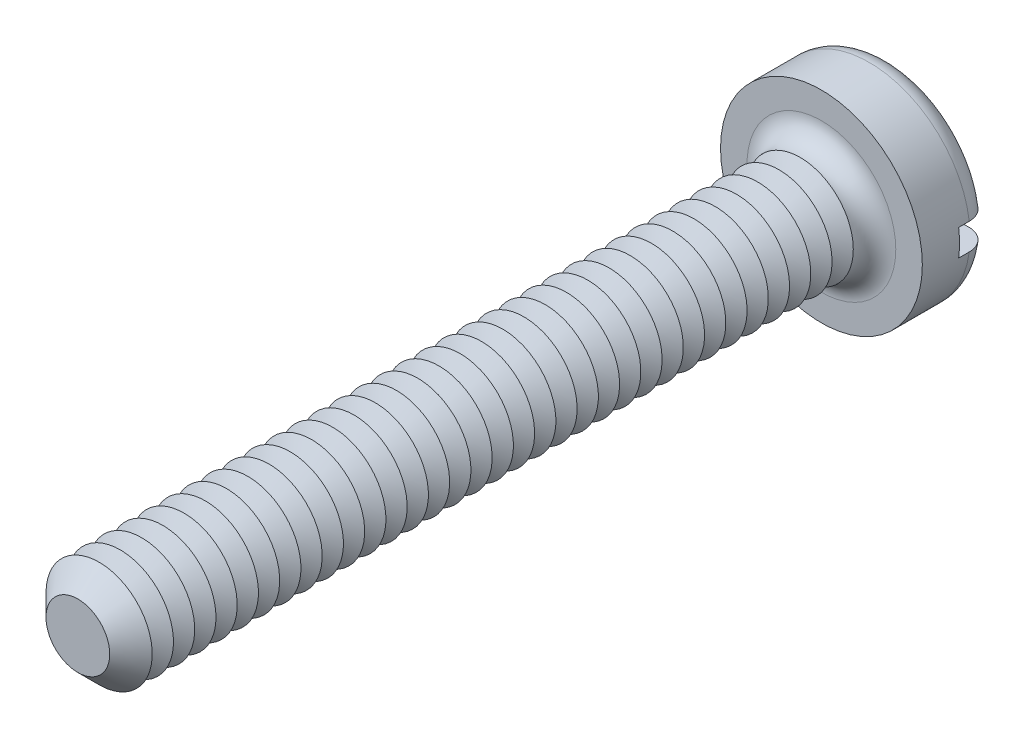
ISO-10303-21;
HEADER;
FILE_DESCRIPTION(('STEP AP214'),'2;1');
FILE_NAME('part.step','',(''),(''),'','','');
FILE_SCHEMA(('AUTOMOTIVE_DESIGN { 1 0 10303 214 1 1 1 1 }'));
ENDSEC;
DATA;
#1=APPLICATION_CONTEXT('core data for automotive mechanical design processes');
#2=APPLICATION_PROTOCOL_DEFINITION('international standard','automotive_design',2000,#1);
#3=PRODUCT_CONTEXT('',#1,'mechanical');
#4=PRODUCT('Part','Part','',(#3));
#5=PRODUCT_RELATED_PRODUCT_CATEGORY('part','',(#4));
#6=PRODUCT_DEFINITION_FORMATION('','',#4);
#7=PRODUCT_DEFINITION_CONTEXT('part definition',#1,'design');
#8=PRODUCT_DEFINITION('design','',#6,#7);
#9=PRODUCT_DEFINITION_SHAPE('','',#8);
#10=(LENGTH_UNIT() NAMED_UNIT(*) SI_UNIT(.MILLI.,.METRE.));
#11=(NAMED_UNIT(*) PLANE_ANGLE_UNIT() SI_UNIT($,.RADIAN.));
#12=(NAMED_UNIT(*) SI_UNIT($,.STERADIAN.) SOLID_ANGLE_UNIT());
#13=UNCERTAINTY_MEASURE_WITH_UNIT(LENGTH_MEASURE(1.E-05),#10,'distance_accuracy_value','');
#14=(GEOMETRIC_REPRESENTATION_CONTEXT(3) GLOBAL_UNCERTAINTY_ASSIGNED_CONTEXT((#13)) GLOBAL_UNIT_ASSIGNED_CONTEXT((#10,
#11,#12)) REPRESENTATION_CONTEXT('',''));
#15=CARTESIAN_POINT('',(0.,0.,0.));
#16=DIRECTION('',(0.,0.,1.));
#17=DIRECTION('',(1.,0.,0.));
#18=AXIS2_PLACEMENT_3D('',#15,#16,#17);
#19=CARTESIAN_POINT('',(0.,0.,-1.3));
#20=DIRECTION('',(0.,0.,1.));
#21=DIRECTION('',(1.,0.,0.));
#22=AXIS2_PLACEMENT_3D('',#19,#20,#21);
#23=PLANE('',#22);
#24=CARTESIAN_POINT('',(0.,0.,-1.3));
#25=DIRECTION('',(0.,0.,1.));
#26=DIRECTION('',(1.,0.,0.));
#27=AXIS2_PLACEMENT_3D('',#24,#25,#26);
#28=CIRCLE('',#27,1.5);
#29=CARTESIAN_POINT('',(-1.4790199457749,0.25,-1.3));
#30=VERTEX_POINT('',#29);
#31=CARTESIAN_POINT('',(1.4790199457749,0.25,-1.3));
#32=VERTEX_POINT('',#31);
#33=EDGE_CURVE('E116',#30,#32,#28,.F.);
#34=ORIENTED_EDGE('',*,*,#33,.T.);
#35=DIRECTION('',(1.,0.,0.));
#36=VECTOR('',#35,1.);
#37=CARTESIAN_POINT('',(-1.9,0.25,-1.3));
#38=LINE('',#37,#36);
#39=EDGE_CURVE('E111',#30,#32,#38,.T.);
#40=ORIENTED_EDGE('',*,*,#39,.F.);
#41=EDGE_LOOP('',(#34,#40));
#42=FACE_BOUND('',#41,.T.);
#43=ADVANCED_FACE('F39',(#42),#23,.F.);
#44=CARTESIAN_POINT('',(0.,0.,-0.9));
#45=DIRECTION('',(0.,0.,1.));
#46=DIRECTION('',(1.,0.,0.));
#47=AXIS2_PLACEMENT_3D('',#44,#45,#46);
#48=TOROIDAL_SURFACE('',#47,1.5,0.4);
#49=CARTESIAN_POINT('',(-1.8150392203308,0.25,-1.12284384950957));
#50=CARTESIAN_POINT('',(-1.80236980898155,0.25,-1.14155059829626));
#51=CARTESIAN_POINT('',(-1.78809920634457,0.25,-1.15919399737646));
#52=CARTESIAN_POINT('',(-1.75677844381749,0.25,-1.19184073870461));
#53=CARTESIAN_POINT('',(-1.73972468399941,0.25,-1.20684060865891));
#54=CARTESIAN_POINT('',(-1.70336024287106,0.25,-1.23375848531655));
#55=CARTESIAN_POINT('',(-1.68405164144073,0.25,-1.24567930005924));
#56=CARTESIAN_POINT('',(-1.64372549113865,0.25,-1.26613528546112));
#57=CARTESIAN_POINT('',(-1.6227083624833,0.25,-1.27467128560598));
#58=CARTESIAN_POINT('',(-1.57937988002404,0.25,-1.2881995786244));
#59=CARTESIAN_POINT('',(-1.55705957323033,0.25,-1.29316318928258));
#60=CARTESIAN_POINT('',(-1.51190394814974,0.25,-1.29931753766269));
#61=CARTESIAN_POINT('',(-1.48906857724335,0.25,-1.3005078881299));
#62=CARTESIAN_POINT('',(-1.4432641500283,0.25,-1.29909058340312));
#63=CARTESIAN_POINT('',(-1.42029638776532,0.25,-1.29644099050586));
#64=CARTESIAN_POINT('',(-1.37512297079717,0.25,-1.28735146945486));
#65=CARTESIAN_POINT('',(-1.3529173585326,0.25,-1.28091133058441));
#66=CARTESIAN_POINT('',(-1.30974098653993,0.25,-1.26436295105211));
#67=CARTESIAN_POINT('',(-1.28877978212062,0.25,-1.25422975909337));
#68=CARTESIAN_POINT('',(-1.24886205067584,0.25,-1.23057736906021));
#69=CARTESIAN_POINT('',(-1.22990554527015,0.25,-1.21705813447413));
#70=CARTESIAN_POINT('',(-1.19461911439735,0.25,-1.18704970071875));
#71=CARTESIAN_POINT('',(-1.17828051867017,0.25,-1.17057070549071));
#72=CARTESIAN_POINT('',(-1.14865897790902,0.25,-1.13506201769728));
#73=CARTESIAN_POINT('',(-1.13537576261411,0.25,-1.11603255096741));
#74=CARTESIAN_POINT('',(-1.11249827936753,0.25,-1.07630328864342));
#75=CARTESIAN_POINT('',(-1.10284494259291,0.25,-1.05563752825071));
#76=CARTESIAN_POINT('',(-1.08724024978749,0.25,-1.01295282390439));
#77=CARTESIAN_POINT('',(-1.08128829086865,0.25,-0.990934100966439));
#78=CARTESIAN_POINT('',(-1.07339124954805,0.25,-0.946722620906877));
#79=CARTESIAN_POINT('',(-1.07135558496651,0.25,-0.924546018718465));
#80=CARTESIAN_POINT('',(-1.07108722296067,0.25,-0.880170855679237));
#81=CARTESIAN_POINT('',(-1.07285419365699,0.25,-0.857972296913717));
#82=CARTESIAN_POINT('',(-1.0800838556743,0.25,-0.814463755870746));
#83=CARTESIAN_POINT('',(-1.08550159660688,0.25,-0.793146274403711));
#84=CARTESIAN_POINT('',(-1.09980522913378,0.25,-0.751709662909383));
#85=CARTESIAN_POINT('',(-1.10869126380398,0.25,-0.731590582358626));
#86=CARTESIAN_POINT('',(-1.12975121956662,0.25,-0.692901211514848));
#87=CARTESIAN_POINT('',(-1.14195627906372,0.25,-0.674347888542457));
#88=CARTESIAN_POINT('',(-1.1692428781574,0.25,-0.639494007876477));
#89=CARTESIAN_POINT('',(-1.18432473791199,0.25,-0.623193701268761));
#90=CARTESIAN_POINT('',(-1.21730350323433,0.25,-0.592916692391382));
#91=CARTESIAN_POINT('',(-1.23525650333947,0.25,-0.579001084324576));
#92=CARTESIAN_POINT('',(-1.27320799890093,0.25,-0.554314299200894));
#93=CARTESIAN_POINT('',(-1.2932067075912,0.25,-0.543543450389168));
#94=CARTESIAN_POINT('',(-1.33509120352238,0.25,-0.525253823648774));
#95=CARTESIAN_POINT('',(-1.35700545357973,0.25,-0.517800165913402));
#96=CARTESIAN_POINT('',(-1.401770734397,0.25,-0.506652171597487));
#97=CARTESIAN_POINT('',(-1.42462180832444,0.25,-0.502958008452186));
#98=CARTESIAN_POINT('',(-1.4707602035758,0.25,-0.499429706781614));
#99=CARTESIAN_POINT('',(-1.49404932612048,0.25,-0.499619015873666));
#100=CARTESIAN_POINT('',(-1.54026206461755,0.25,-0.50392615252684));
#101=CARTESIAN_POINT('',(-1.56318568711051,0.25,-0.508043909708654));
#102=CARTESIAN_POINT('',(-1.60788420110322,0.25,-0.520077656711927));
#103=CARTESIAN_POINT('',(-1.6296645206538,0.25,-0.527973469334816));
#104=CARTESIAN_POINT('',(-1.67156889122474,0.25,-0.547348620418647));
#105=CARTESIAN_POINT('',(-1.69169302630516,0.25,-0.558827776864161));
#106=CARTESIAN_POINT('',(-1.72948251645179,0.25,-0.584913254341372));
#107=CARTESIAN_POINT('',(-1.74717189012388,0.25,-0.599484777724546));
#108=CARTESIAN_POINT('',(-1.77981909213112,0.25,-0.63142070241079));
#109=CARTESIAN_POINT('',(-1.79477707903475,0.25,-0.648784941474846));
#110=CARTESIAN_POINT('',(-1.82136524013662,0.25,-0.685607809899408));
#111=CARTESIAN_POINT('',(-1.83303003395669,0.25,-0.705041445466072));
#112=CARTESIAN_POINT('',(-1.85289960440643,0.25,-0.745602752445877));
#113=CARTESIAN_POINT('',(-1.86110468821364,0.25,-0.76673027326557));
#114=CARTESIAN_POINT('',(-1.87375648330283,0.25,-0.809891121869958));
#115=CARTESIAN_POINT('',(-1.87823381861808,0.25,-0.831915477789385));
#116=CARTESIAN_POINT('',(-1.88341152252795,0.25,-0.87640983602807));
#117=CARTESIAN_POINT('',(-1.88411103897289,0.25,-0.898879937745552));
#118=CARTESIAN_POINT('',(-1.88171559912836,0.25,-0.943534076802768));
#119=CARTESIAN_POINT('',(-1.87863413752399,0.25,-0.965718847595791));
#120=CARTESIAN_POINT('',(-1.86879153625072,0.25,-1.00923650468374));
#121=CARTESIAN_POINT('',(-1.86203494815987,0.25,-1.03057040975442));
#122=CARTESIAN_POINT('',(-1.84837477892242,0.25,-1.06373797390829));
#123=CARTESIAN_POINT('',(-1.84255723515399,0.25,-1.07603047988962));
#124=CARTESIAN_POINT('',(-1.82969924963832,0.25,-1.09995814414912));
#125=CARTESIAN_POINT('',(-1.82265881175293,0.25,-1.11159330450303));
#126=CARTESIAN_POINT('',(-1.8150392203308,0.25,-1.12284384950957));
#127=B_SPLINE_CURVE_WITH_KNOTS('',3,(#49,#50,#51,#52,#53,#54,#55,#56,#57,#58,#59,#60,#61,#62,
#63,#64,#65,#66,#67,#68,#69,#70,#71,#72,#73,#74,#75,#76,#77,#78,#79,#80,#81,#82,#83,#84,#85,#86,
#87,#88,#89,#90,#91,#92,#93,#94,#95,#96,#97,#98,#99,#100,#101,#102,#103,#104,#105,#106,#107,
#108,#109,#110,#111,#112,#113,#114,#115,#116,#117,#118,#119,#120,#121,#122,#123,#124,#125,#126),
.UNSPECIFIED.,.T.,.F.,(4,2,2,2,2,2,2,2,2,2,2,2,2,2,2,2,2,2,2,2,2,2,2,2,2,2,2,2,2,2,2,2,2,2,2,2,
2,2,4),(0.,0.0677296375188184,0.135547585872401,0.203303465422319,0.27104273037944,
0.339319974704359,0.407604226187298,0.47663988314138,0.545679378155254,0.615194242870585,
0.684709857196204,0.753990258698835,0.82326452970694,0.891356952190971,0.959438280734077,
1.02592503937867,1.0924059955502,1.15808300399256,1.2237627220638,1.29008126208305,
1.35640718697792,1.4242376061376,1.49207510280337,1.5611911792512,1.63031044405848,
1.69984715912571,1.76938262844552,1.8385508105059,1.90771547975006,1.97613962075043,
2.04455978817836,2.11223135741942,2.17989691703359,2.24700094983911,2.31412011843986,
2.38100042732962,2.44779809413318,2.48853193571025,2.52926564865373),.UNSPECIFIED.);
#128=CARTESIAN_POINT('',(-1.88348082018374,0.25,-0.9));
#129=VERTEX_POINT('',#128);
#130=EDGE_CURVE('E442',#129,#30,#127,.T.);
#131=ORIENTED_EDGE('',*,*,#130,.F.);
#132=CARTESIAN_POINT('',(0.,0.,-0.9));
#133=DIRECTION('',(0.,0.,1.));
#134=DIRECTION('',(1.,0.,0.));
#135=AXIS2_PLACEMENT_3D('',#132,#133,#134);
#136=CIRCLE('',#135,1.9);
#137=CARTESIAN_POINT('',(1.88348082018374,0.25,-0.9));
#138=VERTEX_POINT('',#137);
#139=EDGE_CURVE('E124',#138,#129,#136,.T.);
#140=ORIENTED_EDGE('',*,*,#139,.F.);
#141=CARTESIAN_POINT('',(1.11362660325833,0.25,-1.07710243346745));
#142=CARTESIAN_POINT('',(1.12388366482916,0.25,-1.09736755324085));
#143=CARTESIAN_POINT('',(1.13589127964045,0.25,-1.11676768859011));
#144=CARTESIAN_POINT('',(1.16301945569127,0.25,-1.15328107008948));
#145=CARTESIAN_POINT('',(1.17814463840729,0.25,-1.17039085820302));
#146=CARTESIAN_POINT('',(1.21101661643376,0.25,-1.20182395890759));
#147=CARTESIAN_POINT('',(1.22875976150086,0.25,-1.21615108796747));
#148=CARTESIAN_POINT('',(1.26636392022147,0.25,-1.24166932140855));
#149=CARTESIAN_POINT('',(1.28622436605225,0.25,-1.25286126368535));
#150=CARTESIAN_POINT('',(1.32781377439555,0.25,-1.27196191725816));
#151=CARTESIAN_POINT('',(1.34956550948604,0.25,-1.27982107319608));
#152=CARTESIAN_POINT('',(1.39407620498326,0.25,-1.29180513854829));
#153=CARTESIAN_POINT('',(1.41683526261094,0.25,-1.29592968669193));
#154=CARTESIAN_POINT('',(1.46288034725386,0.25,-1.3003367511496));
#155=CARTESIAN_POINT('',(1.48616890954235,0.25,-1.30059287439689));
#156=CARTESIAN_POINT('',(1.53245605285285,0.25,-1.29717239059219));
#157=CARTESIAN_POINT('',(1.55545463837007,0.25,-1.29349584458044));
#158=CARTESIAN_POINT('',(1.60038828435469,0.25,-1.28232271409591));
#159=CARTESIAN_POINT('',(1.62232790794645,0.25,-1.27484449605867));
#160=CARTESIAN_POINT('',(1.66461970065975,0.25,-1.25627203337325));
#161=CARTESIAN_POINT('',(1.68497195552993,0.25,-1.24517798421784));
#162=CARTESIAN_POINT('',(1.72328060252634,0.25,-1.21981269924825));
#163=CARTESIAN_POINT('',(1.74126001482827,0.25,-1.2055762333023));
#164=CARTESIAN_POINT('',(1.77453973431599,0.25,-1.17425606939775));
#165=CARTESIAN_POINT('',(1.78984019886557,0.25,-1.1571725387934));
#166=CARTESIAN_POINT('',(1.81715014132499,0.25,-1.12084732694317));
#167=CARTESIAN_POINT('',(1.82919410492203,0.25,-1.10163156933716));
#168=CARTESIAN_POINT('',(1.84985315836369,0.25,-1.06143759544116));
#169=CARTESIAN_POINT('',(1.85846842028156,0.25,-1.04045946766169));
#170=CARTESIAN_POINT('',(1.87195437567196,0.25,-0.997526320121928));
#171=CARTESIAN_POINT('',(1.87685590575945,0.25,-0.975580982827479));
#172=CARTESIAN_POINT('',(1.88288741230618,0.25,-0.931178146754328));
#173=CARTESIAN_POINT('',(1.88401750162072,0.25,-0.908720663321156));
#174=CARTESIAN_POINT('',(1.88247598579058,0.25,-0.864033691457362));
#175=CARTESIAN_POINT('',(1.87982069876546,0.25,-0.841803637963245));
#176=CARTESIAN_POINT('',(1.87081646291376,0.25,-0.798104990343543));
#177=CARTESIAN_POINT('',(1.86446754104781,0.25,-0.776636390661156));
#178=CARTESIAN_POINT('',(1.84826063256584,0.25,-0.735060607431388));
#179=CARTESIAN_POINT('',(1.83840161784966,0.25,-0.714953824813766));
#180=CARTESIAN_POINT('',(1.81546327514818,0.25,-0.676670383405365));
#181=CARTESIAN_POINT('',(1.80238389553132,0.25,-0.658493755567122));
#182=CARTESIAN_POINT('',(1.77331327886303,0.25,-0.62448916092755));
#183=CARTESIAN_POINT('',(1.75730833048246,0.25,-0.608672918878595));
#184=CARTESIAN_POINT('',(1.72289038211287,0.25,-0.579924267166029));
#185=CARTESIAN_POINT('',(1.70447729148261,0.25,-0.566991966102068));
#186=CARTESIAN_POINT('',(1.66559643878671,0.25,-0.544254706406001));
#187=CARTESIAN_POINT('',(1.64511218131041,0.25,-0.53447796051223));
#188=CARTESIAN_POINT('',(1.60280554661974,0.25,-0.518459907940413));
#189=CARTESIAN_POINT('',(1.58098309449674,0.25,-0.512218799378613));
#190=CARTESIAN_POINT('',(1.53636184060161,0.25,-0.503375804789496));
#191=CARTESIAN_POINT('',(1.51355490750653,0.25,-0.500814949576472));
#192=CARTESIAN_POINT('',(1.46783245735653,0.25,-0.499516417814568));
#193=CARTESIAN_POINT('',(1.44491693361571,0.25,-0.500778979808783));
#194=CARTESIAN_POINT('',(1.39937748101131,0.25,-0.50711284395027));
#195=CARTESIAN_POINT('',(1.37675897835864,0.25,-0.512223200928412));
#196=CARTESIAN_POINT('',(1.33269286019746,0.25,-0.526151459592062));
#197=CARTESIAN_POINT('',(1.31124530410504,0.25,-0.534969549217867));
#198=CARTESIAN_POINT('',(1.27004097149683,0.25,-0.556118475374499));
#199=CARTESIAN_POINT('',(1.25029179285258,0.25,-0.568464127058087));
#200=CARTESIAN_POINT('',(1.21316554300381,0.25,-0.59631968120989));
#201=CARTESIAN_POINT('',(1.19578844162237,0.25,-0.611829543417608));
#202=CARTESIAN_POINT('',(1.16406059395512,0.25,-0.645459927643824));
#203=CARTESIAN_POINT('',(1.14968747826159,0.25,-0.663559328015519));
#204=CARTESIAN_POINT('',(1.12425968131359,0.25,-0.70195566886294));
#205=CARTESIAN_POINT('',(1.11320445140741,0.25,-0.722252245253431));
#206=CARTESIAN_POINT('',(1.09497726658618,0.25,-0.764020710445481));
#207=CARTESIAN_POINT('',(1.08772970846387,0.25,-0.785459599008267));
#208=CARTESIAN_POINT('',(1.07702618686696,0.25,-0.829269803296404));
#209=CARTESIAN_POINT('',(1.07357062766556,0.25,-0.851641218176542));
#210=CARTESIAN_POINT('',(1.07060826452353,0.25,-0.896160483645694));
#211=CARTESIAN_POINT('',(1.07101876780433,0.25,-0.918302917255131));
#212=CARTESIAN_POINT('',(1.07557730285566,0.25,-0.962179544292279));
#213=CARTESIAN_POINT('',(1.07972048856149,0.25,-0.983914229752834));
#214=CARTESIAN_POINT('',(1.08912066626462,0.25,-1.01754924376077));
#215=CARTESIAN_POINT('',(1.09320341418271,0.25,-1.02979035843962));
#216=CARTESIAN_POINT('',(1.10254493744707,0.25,-1.05381470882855));
#217=CARTESIAN_POINT('',(1.10780368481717,0.25,-1.06559795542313));
#218=CARTESIAN_POINT('',(1.11362660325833,0.25,-1.07710243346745));
#219=B_SPLINE_CURVE_WITH_KNOTS('',3,(#141,#142,#143,#144,#145,#146,#147,#148,#149,#150,#151,
#152,#153,#154,#155,#156,#157,#158,#159,#160,#161,#162,#163,#164,#165,#166,#167,#168,#169,#170,
#171,#172,#173,#174,#175,#176,#177,#178,#179,#180,#181,#182,#183,#184,#185,#186,#187,#188,#189,
#190,#191,#192,#193,#194,#195,#196,#197,#198,#199,#200,#201,#202,#203,#204,#205,#206,#207,#208,
#209,#210,#211,#212,#213,#214,#215,#216,#217,#218),.UNSPECIFIED.,.T.,.F.,(4,2,2,2,2,2,2,2,2,2,2,
2,2,2,2,2,2,2,2,2,2,2,2,2,2,2,2,2,2,2,2,2,2,2,2,2,2,2,4),(0.,0.0680907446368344,
0.136283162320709,0.204381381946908,0.272461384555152,0.341520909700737,0.410587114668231,
0.480124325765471,0.549660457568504,0.618863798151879,0.688063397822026,0.756532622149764,
0.824997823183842,0.892706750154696,0.960412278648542,1.02754926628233,1.09468424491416,
1.16153068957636,1.22837664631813,1.29524219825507,1.36210882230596,1.42929726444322,
1.49648823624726,1.56426429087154,1.63204414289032,1.70057395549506,1.76910804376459,
1.83834728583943,1.90759003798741,1.97712798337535,2.0466650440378,2.11566422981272,
2.18465199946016,2.25221259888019,2.3197804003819,2.38590630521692,2.45194648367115,
2.49060241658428,2.5292574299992),.UNSPECIFIED.);
#220=EDGE_CURVE('E444',#32,#138,#219,.T.);
#221=ORIENTED_EDGE('',*,*,#220,.F.);
#222=ORIENTED_EDGE('',*,*,#33,.F.);
#223=EDGE_LOOP('',(#131,#140,#221,#222));
#224=FACE_BOUND('',#223,.T.);
#225=ADVANCED_FACE('F426',(#224),#48,.T.);
#226=CARTESIAN_POINT('',(0.,0.,-1.3));
#227=DIRECTION('',(0.,0.,1.));
#228=DIRECTION('',(1.,0.,0.));
#229=AXIS2_PLACEMENT_3D('',#226,#227,#228);
#230=CYLINDRICAL_SURFACE('',#229,1.9);
#231=DIRECTION('',(0.,0.,1.));
#232=VECTOR('',#231,1.);
#233=CARTESIAN_POINT('',(1.88348082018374,0.25,-1.3));
#234=LINE('',#233,#232);
#235=CARTESIAN_POINT('',(1.88348082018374,0.25,-0.7));
#236=VERTEX_POINT('',#235);
#237=EDGE_CURVE('E460',#138,#236,#234,.T.);
#238=ORIENTED_EDGE('',*,*,#237,.F.);
#239=ORIENTED_EDGE('',*,*,#139,.T.);
#240=DIRECTION('',(0.,0.,1.));
#241=VECTOR('',#240,1.);
#242=CARTESIAN_POINT('',(-1.88348082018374,0.25,-1.3));
#243=LINE('',#242,#241);
#244=CARTESIAN_POINT('',(-1.88348082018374,0.25,-0.7));
#245=VERTEX_POINT('',#244);
#246=EDGE_CURVE('E63',#245,#129,#243,.F.);
#247=ORIENTED_EDGE('',*,*,#246,.F.);
#248=CARTESIAN_POINT('',(0.,0.,-0.7));
#249=DIRECTION('',(0.,0.,-1.));
#250=DIRECTION('',(-1.,0.,0.));
#251=AXIS2_PLACEMENT_3D('',#248,#249,#250);
#252=CIRCLE('',#251,1.9);
#253=CARTESIAN_POINT('',(-1.88348082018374,-0.25,-0.7));
#254=VERTEX_POINT('',#253);
#255=EDGE_CURVE('E43',#245,#254,#252,.F.);
#256=ORIENTED_EDGE('',*,*,#255,.T.);
#257=DIRECTION('',(0.,0.,1.));
#258=VECTOR('',#257,1.);
#259=CARTESIAN_POINT('',(-1.88348082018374,-0.25,-1.3));
#260=LINE('',#259,#258);
#261=CARTESIAN_POINT('',(-1.88348082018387,-0.25,-0.899999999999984));
#262=VERTEX_POINT('',#261);
#263=EDGE_CURVE('E457',#262,#254,#260,.T.);
#264=ORIENTED_EDGE('',*,*,#263,.F.);
#265=CARTESIAN_POINT('',(1.88348082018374,-0.25,-0.9));
#266=VERTEX_POINT('',#265);
#267=EDGE_CURVE('E126',#262,#266,#136,.T.);
#268=ORIENTED_EDGE('',*,*,#267,.T.);
#269=DIRECTION('',(0.,0.,1.));
#270=VECTOR('',#269,1.);
#271=CARTESIAN_POINT('',(1.88348082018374,-0.25,-1.3));
#272=LINE('',#271,#270);
#273=CARTESIAN_POINT('',(1.88348082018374,-0.25,-0.7));
#274=VERTEX_POINT('',#273);
#275=EDGE_CURVE('E55',#274,#266,#272,.F.);
#276=ORIENTED_EDGE('',*,*,#275,.F.);
#277=EDGE_CURVE('E11',#274,#236,#252,.F.);
#278=ORIENTED_EDGE('',*,*,#277,.T.);
#279=EDGE_LOOP('',(#238,#239,#247,#256,#264,#268,#276,#278));
#280=FACE_BOUND('',#279,.T.);
#281=CARTESIAN_POINT('',(0.,0.,0.));
#282=DIRECTION('',(0.,0.,1.));
#283=DIRECTION('',(1.,0.,0.));
#284=AXIS2_PLACEMENT_3D('',#281,#282,#283);
#285=CIRCLE('',#284,1.9);
#286=CARTESIAN_POINT('',(1.9,0.,0.));
#287=VERTEX_POINT('',#286);
#288=EDGE_CURVE('E463',#287,#287,#285,.T.);
#289=ORIENTED_EDGE('',*,*,#288,.F.);
#290=EDGE_LOOP('',(#289));
#291=FACE_BOUND('',#290,.T.);
#292=ADVANCED_FACE('F422',(#280,#291),#230,.T.);
#293=CARTESIAN_POINT('',(1.4790199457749,-0.25,-1.3));
#294=VERTEX_POINT('',#293);
#295=CARTESIAN_POINT('',(-1.4790199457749,-0.25,-1.3));
#296=VERTEX_POINT('',#295);
#297=EDGE_CURVE('E109',#294,#296,#28,.F.);
#298=ORIENTED_EDGE('',*,*,#297,.T.);
#299=DIRECTION('',(-1.,0.,0.));
#300=VECTOR('',#299,1.);
#301=CARTESIAN_POINT('',(-1.9,-0.25,-1.3));
#302=LINE('',#301,#300);
#303=EDGE_CURVE('E96',#294,#296,#302,.T.);
#304=ORIENTED_EDGE('',*,*,#303,.F.);
#305=EDGE_LOOP('',(#298,#304));
#306=FACE_BOUND('',#305,.T.);
#307=ADVANCED_FACE('F108',(#306),#23,.F.);
#308=CARTESIAN_POINT('',(0.,0.,0.));
#309=DIRECTION('',(0.,0.,1.));
#310=DIRECTION('',(1.,0.,0.));
#311=AXIS2_PLACEMENT_3D('',#308,#309,#310);
#312=PLANE('',#311);
#313=CARTESIAN_POINT('',(0.,0.,0.));
#314=DIRECTION('',(0.,0.,1.));
#315=DIRECTION('',(1.,0.,0.));
#316=AXIS2_PLACEMENT_3D('',#313,#314,#315);
#317=CIRCLE('',#316,1.4);
#318=CARTESIAN_POINT('',(1.4,0.,0.));
#319=VERTEX_POINT('',#318);
#320=EDGE_CURVE('E115',#319,#319,#317,.F.);
#321=ORIENTED_EDGE('',*,*,#320,.T.);
#322=EDGE_LOOP('',(#321));
#323=FACE_BOUND('',#322,.T.);
#324=ORIENTED_EDGE('',*,*,#288,.T.);
#325=EDGE_LOOP('',(#324));
#326=FACE_BOUND('',#325,.T.);
#327=ADVANCED_FACE('F421',(#323,#326),#312,.T.);
#328=CARTESIAN_POINT('',(-1.8150392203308,-0.25,-1.12284384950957));
#329=CARTESIAN_POINT('',(-1.82756185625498,-0.25,-1.10435021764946));
#330=CARTESIAN_POINT('',(-1.83853807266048,-0.25,-1.08479072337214));
#331=CARTESIAN_POINT('',(-1.85706233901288,-0.25,-1.04409188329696));
#332=CARTESIAN_POINT('',(-1.86460655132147,-0.25,-1.02295079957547));
#333=CARTESIAN_POINT('',(-1.87603074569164,-0.25,-0.979704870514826));
#334=CARTESIAN_POINT('',(-1.87991177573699,-0.25,-0.957600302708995));
#335=CARTESIAN_POINT('',(-1.88389586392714,-0.25,-0.913058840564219));
#336=CARTESIAN_POINT('',(-1.88399981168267,-0.25,-0.890622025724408));
#337=CARTESIAN_POINT('',(-1.88043374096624,-0.25,-0.846104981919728));
#338=CARTESIAN_POINT('',(-1.87677281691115,-0.25,-0.824024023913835));
#339=CARTESIAN_POINT('',(-1.86579880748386,-0.25,-0.780788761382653));
#340=CARTESIAN_POINT('',(-1.85848560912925,-0.25,-0.759634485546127));
#341=CARTESIAN_POINT('',(-1.8404137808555,-0.25,-0.718830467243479));
#342=CARTESIAN_POINT('',(-1.82965205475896,-0.25,-0.699182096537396));
#343=CARTESIAN_POINT('',(-1.80499939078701,-0.25,-0.661958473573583));
#344=CARTESIAN_POINT('',(-1.7911083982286,-0.25,-0.644383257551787));
#345=CARTESIAN_POINT('',(-1.76051564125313,-0.25,-0.611699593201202));
#346=CARTESIAN_POINT('',(-1.74379913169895,-0.25,-0.596604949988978));
#347=CARTESIAN_POINT('',(-1.70808901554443,-0.25,-0.569406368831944));
#348=CARTESIAN_POINT('',(-1.68909532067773,-0.25,-0.557302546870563));
#349=CARTESIAN_POINT('',(-1.64918615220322,-0.25,-0.536307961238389));
#350=CARTESIAN_POINT('',(-1.62825469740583,-0.25,-0.527447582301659));
#351=CARTESIAN_POINT('',(-1.58521203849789,-0.25,-0.513323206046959));
#352=CARTESIAN_POINT('',(-1.5631007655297,-0.25,-0.508059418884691));
#353=CARTESIAN_POINT('',(-1.51806209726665,-0.25,-0.501215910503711));
#354=CARTESIAN_POINT('',(-1.4951283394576,-0.25,-0.499678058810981));
#355=CARTESIAN_POINT('',(-1.4493239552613,-0.25,-0.500434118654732));
#356=CARTESIAN_POINT('',(-1.4264533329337,-0.25,-0.502728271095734));
#357=CARTESIAN_POINT('',(-1.38118643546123,-0.25,-0.511115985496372));
#358=CARTESIAN_POINT('',(-1.35879703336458,-0.25,-0.51724667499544));
#359=CARTESIAN_POINT('',(-1.31535851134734,-0.25,-0.533167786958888));
#360=CARTESIAN_POINT('',(-1.29430945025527,-0.25,-0.542958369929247));
#361=CARTESIAN_POINT('',(-1.25409242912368,-0.25,-0.565968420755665));
#362=CARTESIAN_POINT('',(-1.23493023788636,-0.25,-0.579197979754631));
#363=CARTESIAN_POINT('',(-1.19912477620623,-0.25,-0.608715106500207));
#364=CARTESIAN_POINT('',(-1.18248143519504,-0.25,-0.625002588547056));
#365=CARTESIAN_POINT('',(-1.15237533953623,-0.25,-0.660018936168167));
#366=CARTESIAN_POINT('',(-1.13888343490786,-0.25,-0.678722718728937));
#367=CARTESIAN_POINT('',(-1.115312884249,-0.25,-0.718170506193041));
#368=CARTESIAN_POINT('',(-1.10523377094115,-0.25,-0.738914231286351));
#369=CARTESIAN_POINT('',(-1.08901310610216,-0.25,-0.781372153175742));
#370=CARTESIAN_POINT('',(-1.08279080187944,-0.25,-0.803055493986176));
#371=CARTESIAN_POINT('',(-1.07416105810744,-0.25,-0.847167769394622));
#372=CARTESIAN_POINT('',(-1.07175306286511,-0.25,-0.869596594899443));
#373=CARTESIAN_POINT('',(-1.07084656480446,-0.25,-0.914070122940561));
#374=CARTESIAN_POINT('',(-1.07226874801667,-0.25,-0.936113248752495));
#375=CARTESIAN_POINT('',(-1.07880428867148,-0.25,-0.979644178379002));
#376=CARTESIAN_POINT('',(-1.08391755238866,-0.25,-1.00113199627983));
#377=CARTESIAN_POINT('',(-1.09764616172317,-0.25,-1.04290115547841));
#378=CARTESIAN_POINT('',(-1.10625346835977,-0.25,-1.06318514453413));
#379=CARTESIAN_POINT('',(-1.12669365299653,-0.25,-1.10205584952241));
#380=CARTESIAN_POINT('',(-1.13852679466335,-0.25,-1.12064242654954));
#381=CARTESIAN_POINT('',(-1.16529672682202,-0.25,-1.15594801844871));
#382=CARTESIAN_POINT('',(-1.18028464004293,-0.25,-1.17262825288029));
#383=CARTESIAN_POINT('',(-1.21279183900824,-0.25,-1.20330600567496));
#384=CARTESIAN_POINT('',(-1.23031142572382,-0.25,-1.21730320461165));
#385=CARTESIAN_POINT('',(-1.26781695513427,-0.25,-1.24254670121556));
#386=CARTESIAN_POINT('',(-1.28784999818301,-0.25,-1.25372305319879));
#387=CARTESIAN_POINT('',(-1.3294899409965,-0.25,-1.27260611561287));
#388=CARTESIAN_POINT('',(-1.35109697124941,-0.25,-1.28031253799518));
#389=CARTESIAN_POINT('',(-1.39558575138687,-0.25,-1.29212626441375));
#390=CARTESIAN_POINT('',(-1.4184807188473,-0.25,-1.29618386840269));
#391=CARTESIAN_POINT('',(-1.4646266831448,-0.25,-1.30039947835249));
#392=CARTESIAN_POINT('',(-1.48787767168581,-0.25,-1.30055757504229));
#393=CARTESIAN_POINT('',(-1.53407883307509,-0.25,-1.29695468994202));
#394=CARTESIAN_POINT('',(-1.55702895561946,-0.25,-1.29319306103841));
#395=CARTESIAN_POINT('',(-1.60196718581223,-0.25,-1.28183520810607));
#396=CARTESIAN_POINT('',(-1.62395508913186,-0.25,-1.27423817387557));
#397=CARTESIAN_POINT('',(-1.66614393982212,-0.25,-1.25548646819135));
#398=CARTESIAN_POINT('',(-1.68635782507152,-0.25,-1.24436087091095));
#399=CARTESIAN_POINT('',(-1.72458266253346,-0.25,-1.21884344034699));
#400=CARTESIAN_POINT('',(-1.74259637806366,-0.25,-1.20445577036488));
#401=CARTESIAN_POINT('',(-1.76968989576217,-0.25,-1.1787247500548));
#402=CARTESIAN_POINT('',(-1.77959984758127,-0.25,-1.1682407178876));
#403=CARTESIAN_POINT('',(-1.79823423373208,-0.25,-1.14626700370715));
#404=CARTESIAN_POINT('',(-1.80695867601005,-0.25,-1.1347773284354));
#405=CARTESIAN_POINT('',(-1.8150392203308,-0.25,-1.12284384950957));
#406=B_SPLINE_CURVE_WITH_KNOTS('',3,(#328,#329,#330,#331,#332,#333,#334,#335,#336,#337,#338,
#339,#340,#341,#342,#343,#344,#345,#346,#347,#348,#349,#350,#351,#352,#353,#354,#355,#356,#357,
#358,#359,#360,#361,#362,#363,#364,#365,#366,#367,#368,#369,#370,#371,#372,#373,#374,#375,#376,
#377,#378,#379,#380,#381,#382,#383,#384,#385,#386,#387,#388,#389,#390,#391,#392,#393,#394,#395,
#396,#397,#398,#399,#400,#401,#402,#403,#404,#405),.UNSPECIFIED.,.T.,.F.,(4,2,2,2,2,2,2,2,2,2,2,
2,2,2,2,2,2,2,2,2,2,2,2,2,2,2,2,2,2,2,2,2,2,2,2,2,2,2,4),(0.,0.0669512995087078,
0.133977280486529,0.200984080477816,0.267975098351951,0.334804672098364,0.401636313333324,
0.468528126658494,0.535421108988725,0.602674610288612,0.669930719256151,0.737801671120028,
0.805676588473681,0.87431077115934,0.942949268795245,1.0122625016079,1.08157877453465,
1.15110078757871,1.22062085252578,1.28946987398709,1.35830946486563,1.42565417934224,
1.49298908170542,1.55894041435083,1.62489007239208,1.69068884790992,1.75649300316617,
1.82345932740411,1.89043361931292,1.95893391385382,2.02743989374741,2.09686543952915,
2.16628937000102,2.23572476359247,2.3051748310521,2.3740669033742,2.44287154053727,
2.48607383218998,2.52927583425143),.UNSPECIFIED.);
#407=EDGE_CURVE('E103',#296,#262,#406,.T.);
#408=ORIENTED_EDGE('',*,*,#407,.F.);
#409=ORIENTED_EDGE('',*,*,#297,.F.);
#410=CARTESIAN_POINT('',(1.11362660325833,-0.25,-1.07710243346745));
#411=CARTESIAN_POINT('',(1.10368387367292,-0.25,-1.05745397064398));
#412=CARTESIAN_POINT('',(1.09537204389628,-0.25,-1.0369644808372));
#413=CARTESIAN_POINT('',(1.08229212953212,-0.25,-0.994867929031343));
#414=CARTESIAN_POINT('',(1.07752732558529,-0.25,-0.973259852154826));
#415=CARTESIAN_POINT('',(1.07171197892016,-0.25,-0.929545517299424));
#416=CARTESIAN_POINT('',(1.07066166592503,-0.25,-0.907439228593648));
#417=CARTESIAN_POINT('',(1.07231382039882,-0.25,-0.863372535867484));
#418=CARTESIAN_POINT('',(1.07501551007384,-0.25,-0.841412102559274));
#419=CARTESIAN_POINT('',(1.08404966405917,-0.25,-0.798386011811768));
#420=CARTESIAN_POINT('',(1.09036099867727,-0.25,-0.777315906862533));
#421=CARTESIAN_POINT('',(1.10638973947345,-0.25,-0.736514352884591));
#422=CARTESIAN_POINT('',(1.11610743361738,-0.25,-0.716783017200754));
#423=CARTESIAN_POINT('',(1.13878208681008,-0.25,-0.678952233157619));
#424=CARTESIAN_POINT('',(1.15177705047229,-0.25,-0.660875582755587));
#425=CARTESIAN_POINT('',(1.18055347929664,-0.25,-0.62709692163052));
#426=CARTESIAN_POINT('',(1.19633525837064,-0.25,-0.611395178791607));
#427=CARTESIAN_POINT('',(1.23062926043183,-0.25,-0.582430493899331));
#428=CARTESIAN_POINT('',(1.24919608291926,-0.25,-0.569232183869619));
#429=CARTESIAN_POINT('',(1.28825118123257,-0.25,-0.546076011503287));
#430=CARTESIAN_POINT('',(1.30873964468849,-0.25,-0.536118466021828));
#431=CARTESIAN_POINT('',(1.35144534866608,-0.25,-0.519560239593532));
#432=CARTESIAN_POINT('',(1.3736865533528,-0.25,-0.513021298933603));
#433=CARTESIAN_POINT('',(1.41894945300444,-0.25,-0.503751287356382));
#434=CARTESIAN_POINT('',(1.44197117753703,-0.25,-0.50102036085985));
#435=CARTESIAN_POINT('',(1.48824913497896,-0.25,-0.499449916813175));
#436=CARTESIAN_POINT('',(1.5115059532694,-0.25,-0.500627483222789));
#437=CARTESIAN_POINT('',(1.55748678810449,-0.25,-0.506895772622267));
#438=CARTESIAN_POINT('',(1.58021081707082,-0.25,-0.511986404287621));
#439=CARTESIAN_POINT('',(1.6243247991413,-0.25,-0.525910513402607));
#440=CARTESIAN_POINT('',(1.64572225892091,-0.25,-0.534720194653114));
#441=CARTESIAN_POINT('',(1.68671060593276,-0.25,-0.555845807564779));
#442=CARTESIAN_POINT('',(1.70630159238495,-0.25,-0.568161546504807));
#443=CARTESIAN_POINT('',(1.74289060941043,-0.25,-0.595805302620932));
#444=CARTESIAN_POINT('',(1.75991474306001,-0.25,-0.611098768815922));
#445=CARTESIAN_POINT('',(1.79111916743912,-0.25,-0.644354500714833));
#446=CARTESIAN_POINT('',(1.80529962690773,-0.25,-0.662316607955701));
#447=CARTESIAN_POINT('',(1.83025525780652,-0.25,-0.700191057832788));
#448=CARTESIAN_POINT('',(1.84106535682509,-0.25,-0.720080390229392));
#449=CARTESIAN_POINT('',(1.8591630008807,-0.25,-0.761401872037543));
#450=CARTESIAN_POINT('',(1.86645070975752,-0.25,-0.782833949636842));
#451=CARTESIAN_POINT('',(1.87724305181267,-0.25,-0.826454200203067));
#452=CARTESIAN_POINT('',(1.88077646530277,-0.25,-0.848635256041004));
#453=CARTESIAN_POINT('',(1.88405487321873,-0.25,-0.89327539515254));
#454=CARTESIAN_POINT('',(1.88379996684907,-0.25,-0.915734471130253));
#455=CARTESIAN_POINT('',(1.87951702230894,-0.25,-0.96021054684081));
#456=CARTESIAN_POINT('',(1.87550211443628,-0.25,-0.982228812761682));
#457=CARTESIAN_POINT('',(1.86383665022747,-0.25,-1.0252797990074));
#458=CARTESIAN_POINT('',(1.85618610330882,-0.25,-1.04631252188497));
#459=CARTESIAN_POINT('',(1.83746332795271,-0.25,-1.08682395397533));
#460=CARTESIAN_POINT('',(1.82638722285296,-0.25,-1.10630087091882));
#461=CARTESIAN_POINT('',(1.80113946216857,-0.25,-1.14313202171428));
#462=CARTESIAN_POINT('',(1.78696774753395,-0.25,-1.1604862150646));
#463=CARTESIAN_POINT('',(1.75585044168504,-0.25,-1.19268694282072));
#464=CARTESIAN_POINT('',(1.73888979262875,-0.25,-1.20751892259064));
#465=CARTESIAN_POINT('',(1.7027387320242,-0.25,-1.23415579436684));
#466=CARTESIAN_POINT('',(1.68354822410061,-0.25,-1.24596055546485));
#467=CARTESIAN_POINT('',(1.64329341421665,-0.25,-1.26632784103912));
#468=CARTESIAN_POINT('',(1.62221336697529,-0.25,-1.27485924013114));
#469=CARTESIAN_POINT('',(1.5789301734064,-0.25,-1.28830571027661));
#470=CARTESIAN_POINT('',(1.55672695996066,-0.25,-1.29322056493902));
#471=CARTESIAN_POINT('',(1.5115614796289,-0.25,-1.29935191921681));
#472=CARTESIAN_POINT('',(1.4885934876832,-0.25,-1.30052625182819));
#473=CARTESIAN_POINT('',(1.44278240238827,-0.25,-1.2990417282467));
#474=CARTESIAN_POINT('',(1.41993931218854,-0.25,-1.29638277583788));
#475=CARTESIAN_POINT('',(1.37479511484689,-0.25,-1.28727159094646));
#476=CARTESIAN_POINT('',(1.35250125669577,-0.25,-1.2807834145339));
#477=CARTESIAN_POINT('',(1.30930729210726,-0.25,-1.2641644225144));
#478=CARTESIAN_POINT('',(1.2884075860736,-0.25,-1.25403256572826));
#479=CARTESIAN_POINT('',(1.24854853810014,-0.25,-1.23036781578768));
#480=CARTESIAN_POINT('',(1.22959511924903,-0.25,-1.21682495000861));
#481=CARTESIAN_POINT('',(1.19427766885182,-0.25,-1.18672803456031));
#482=CARTESIAN_POINT('',(1.17791048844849,-0.25,-1.170177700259));
#483=CARTESIAN_POINT('',(1.15346856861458,-0.25,-1.14079355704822));
#484=CARTESIAN_POINT('',(1.14449891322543,-0.25,-1.12869247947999));
#485=CARTESIAN_POINT('',(1.12797460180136,-0.25,-1.10355927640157));
#486=CARTESIAN_POINT('',(1.1204199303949,-0.25,-1.09052716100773));
#487=CARTESIAN_POINT('',(1.11362660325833,-0.25,-1.07710243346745));
#488=B_SPLINE_CURVE_WITH_KNOTS('',3,(#410,#411,#412,#413,#414,#415,#416,#417,#418,#419,#420,
#421,#422,#423,#424,#425,#426,#427,#428,#429,#430,#431,#432,#433,#434,#435,#436,#437,#438,#439,
#440,#441,#442,#443,#444,#445,#446,#447,#448,#449,#450,#451,#452,#453,#454,#455,#456,#457,#458,
#459,#460,#461,#462,#463,#464,#465,#466,#467,#468,#469,#470,#471,#472,#473,#474,#475,#476,#477,
#478,#479,#480,#481,#482,#483,#484,#485,#486,#487),.UNSPECIFIED.,.T.,.F.,(4,2,2,2,2,2,2,2,2,2,2,
2,2,2,2,2,2,2,2,2,2,2,2,2,2,2,2,2,2,2,2,2,2,2,2,2,2,2,4),(0.,0.0660089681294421,
0.132078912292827,0.198152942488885,0.26421327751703,0.329890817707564,0.395573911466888,
0.462056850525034,0.528547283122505,0.596571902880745,0.664603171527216,0.733823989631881,
0.803047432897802,0.872573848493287,0.94209864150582,1.01118516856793,1.08026789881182,
1.14859228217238,1.21691261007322,1.28449938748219,1.35208302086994,1.41914473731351,
1.48620469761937,1.55303134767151,1.61985782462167,1.68676020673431,1.75366386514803,
1.82094137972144,1.88822180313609,1.95612699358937,2.0240362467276,2.09270838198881,
2.16138224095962,2.23071121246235,2.30006001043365,2.36961396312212,2.4390825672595,
2.48418340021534,2.52928374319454),.UNSPECIFIED.);
#489=EDGE_CURVE('E92',#266,#294,#488,.T.);
#490=ORIENTED_EDGE('',*,*,#489,.F.);
#491=ORIENTED_EDGE('',*,*,#267,.F.);
#492=EDGE_LOOP('',(#408,#409,#490,#491));
#493=FACE_BOUND('',#492,.T.);
#494=ADVANCED_FACE('F113',(#493),#48,.T.);
#495=CARTESIAN_POINT('',(0.,0.,0.399999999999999));
#496=DIRECTION('',(0.,0.,1.));
#497=DIRECTION('',(1.,0.,0.));
#498=AXIS2_PLACEMENT_3D('',#495,#496,#497);
#499=TOROIDAL_SURFACE('',#498,1.4,0.4);
#500=ORIENTED_EDGE('',*,*,#320,.F.);
#501=EDGE_LOOP('',(#500));
#502=FACE_BOUND('',#501,.T.);
#503=CARTESIAN_POINT('',(0.,0.,0.399999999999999));
#504=DIRECTION('',(0.,0.,-1.));
#505=DIRECTION('',(-1.,0.,0.));
#506=AXIS2_PLACEMENT_3D('',#503,#504,#505);
#507=CIRCLE('',#506,1.);
#508=CARTESIAN_POINT('',(-1.,0.,0.399999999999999));
#509=VERTEX_POINT('',#508);
#510=EDGE_CURVE('E469',#509,#509,#507,.T.);
#511=ORIENTED_EDGE('',*,*,#510,.T.);
#512=EDGE_LOOP('',(#511));
#513=FACE_BOUND('',#512,.T.);
#514=ADVANCED_FACE('F414',(#502,#513),#499,.F.);
#515=CARTESIAN_POINT('',(0.,0.,0.599999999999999));
#516=DIRECTION('',(0.,0.,-1.));
#517=DIRECTION('',(-1.,0.,0.));
#518=AXIS2_PLACEMENT_3D('',#515,#516,#517);
#519=CONICAL_SURFACE('',#518,0.653589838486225,1.0471975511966);
#520=ORIENTED_EDGE('',*,*,#510,.F.);
#521=EDGE_LOOP('',(#520));
#522=FACE_BOUND('',#521,.T.);
#523=CARTESIAN_POINT('',(0.,0.,0.599999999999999));
#524=DIRECTION('',(0.,0.,-1.));
#525=DIRECTION('',(-1.,0.,0.));
#526=AXIS2_PLACEMENT_3D('',#523,#524,#525);
#527=CIRCLE('',#526,0.653589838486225);
#528=CARTESIAN_POINT('',(-0.653589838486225,0.,0.599999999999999));
#529=VERTEX_POINT('',#528);
#530=EDGE_CURVE('E475',#529,#529,#527,.T.);
#531=ORIENTED_EDGE('',*,*,#530,.T.);
#532=EDGE_LOOP('',(#531));
#533=FACE_BOUND('',#532,.T.);
#534=ADVANCED_FACE('F410',(#522,#533),#519,.T.);
#535=CARTESIAN_POINT('',(0.,0.,0.799999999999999));
#536=DIRECTION('',(0.,0.,1.));
#537=DIRECTION('',(1.,0.,0.));
#538=AXIS2_PLACEMENT_3D('',#535,#536,#537);
#539=CONICAL_SURFACE('',#538,1.,1.0471975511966);
#540=ORIENTED_EDGE('',*,*,#530,.F.);
#541=EDGE_LOOP('',(#540));
#542=FACE_BOUND('',#541,.T.);
#543=CARTESIAN_POINT('',(0.,0.,0.799999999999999));
#544=DIRECTION('',(0.,0.,-1.));
#545=DIRECTION('',(-1.,0.,0.));
#546=AXIS2_PLACEMENT_3D('',#543,#544,#545);
#547=CIRCLE('',#546,1.);
#548=CARTESIAN_POINT('',(-1.,0.,0.799999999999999));
#549=VERTEX_POINT('',#548);
#550=EDGE_CURVE('E481',#549,#549,#547,.T.);
#551=ORIENTED_EDGE('',*,*,#550,.T.);
#552=EDGE_LOOP('',(#551));
#553=FACE_BOUND('',#552,.T.);
#554=ADVANCED_FACE('F406',(#542,#553),#539,.T.);
#555=CARTESIAN_POINT('',(0.,0.,0.999999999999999));
#556=DIRECTION('',(0.,0.,-1.));
#557=DIRECTION('',(-1.,0.,0.));
#558=AXIS2_PLACEMENT_3D('',#555,#556,#557);
#559=CONICAL_SURFACE('',#558,0.653589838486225,1.0471975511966);
#560=ORIENTED_EDGE('',*,*,#550,.F.);
#561=EDGE_LOOP('',(#560));
#562=FACE_BOUND('',#561,.T.);
#563=CARTESIAN_POINT('',(0.,0.,0.999999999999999));
#564=DIRECTION('',(0.,0.,-1.));
#565=DIRECTION('',(-1.,0.,0.));
#566=AXIS2_PLACEMENT_3D('',#563,#564,#565);
#567=CIRCLE('',#566,0.653589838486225);
#568=CARTESIAN_POINT('',(-0.653589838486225,0.,0.999999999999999));
#569=VERTEX_POINT('',#568);
#570=EDGE_CURVE('E485',#569,#569,#567,.T.);
#571=ORIENTED_EDGE('',*,*,#570,.T.);
#572=EDGE_LOOP('',(#571));
#573=FACE_BOUND('',#572,.T.);
#574=ADVANCED_FACE('F402',(#562,#573),#559,.T.);
#575=CARTESIAN_POINT('',(0.,0.,1.2));
#576=DIRECTION('',(0.,0.,1.));
#577=DIRECTION('',(1.,0.,0.));
#578=AXIS2_PLACEMENT_3D('',#575,#576,#577);
#579=CONICAL_SURFACE('',#578,1.,1.0471975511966);
#580=ORIENTED_EDGE('',*,*,#570,.F.);
#581=EDGE_LOOP('',(#580));
#582=FACE_BOUND('',#581,.T.);
#583=CARTESIAN_POINT('',(0.,0.,1.2));
#584=DIRECTION('',(0.,0.,-1.));
#585=DIRECTION('',(-1.,0.,0.));
#586=AXIS2_PLACEMENT_3D('',#583,#584,#585);
#587=CIRCLE('',#586,1.);
#588=CARTESIAN_POINT('',(-1.,0.,1.2));
#589=VERTEX_POINT('',#588);
#590=EDGE_CURVE('E489',#589,#589,#587,.T.);
#591=ORIENTED_EDGE('',*,*,#590,.T.);
#592=EDGE_LOOP('',(#591));
#593=FACE_BOUND('',#592,.T.);
#594=ADVANCED_FACE('F398',(#582,#593),#579,.T.);
#595=CARTESIAN_POINT('',(0.,0.,1.4));
#596=DIRECTION('',(0.,0.,-1.));
#597=DIRECTION('',(-1.,0.,0.));
#598=AXIS2_PLACEMENT_3D('',#595,#596,#597);
#599=CONICAL_SURFACE('',#598,0.653589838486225,1.0471975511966);
#600=ORIENTED_EDGE('',*,*,#590,.F.);
#601=EDGE_LOOP('',(#600));
#602=FACE_BOUND('',#601,.T.);
#603=CARTESIAN_POINT('',(0.,0.,1.4));
#604=DIRECTION('',(0.,0.,-1.));
#605=DIRECTION('',(-1.,0.,0.));
#606=AXIS2_PLACEMENT_3D('',#603,#604,#605);
#607=CIRCLE('',#606,0.653589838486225);
#608=CARTESIAN_POINT('',(-0.653589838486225,0.,1.4));
#609=VERTEX_POINT('',#608);
#610=EDGE_CURVE('E493',#609,#609,#607,.T.);
#611=ORIENTED_EDGE('',*,*,#610,.T.);
#612=EDGE_LOOP('',(#611));
#613=FACE_BOUND('',#612,.T.);
#614=ADVANCED_FACE('F394',(#602,#613),#599,.T.);
#615=CARTESIAN_POINT('',(0.,0.,1.6));
#616=DIRECTION('',(0.,0.,1.));
#617=DIRECTION('',(1.,0.,0.));
#618=AXIS2_PLACEMENT_3D('',#615,#616,#617);
#619=CONICAL_SURFACE('',#618,1.,1.0471975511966);
#620=ORIENTED_EDGE('',*,*,#610,.F.);
#621=EDGE_LOOP('',(#620));
#622=FACE_BOUND('',#621,.T.);
#623=CARTESIAN_POINT('',(0.,0.,1.6));
#624=DIRECTION('',(0.,0.,-1.));
#625=DIRECTION('',(-1.,0.,0.));
#626=AXIS2_PLACEMENT_3D('',#623,#624,#625);
#627=CIRCLE('',#626,1.);
#628=CARTESIAN_POINT('',(-1.,0.,1.6));
#629=VERTEX_POINT('',#628);
#630=EDGE_CURVE('E496',#629,#629,#627,.T.);
#631=ORIENTED_EDGE('',*,*,#630,.T.);
#632=EDGE_LOOP('',(#631));
#633=FACE_BOUND('',#632,.T.);
#634=ADVANCED_FACE('F390',(#622,#633),#619,.T.);
#635=CARTESIAN_POINT('',(0.,0.,1.8));
#636=DIRECTION('',(0.,0.,-1.));
#637=DIRECTION('',(-1.,0.,0.));
#638=AXIS2_PLACEMENT_3D('',#635,#636,#637);
#639=CONICAL_SURFACE('',#638,0.653589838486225,1.0471975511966);
#640=ORIENTED_EDGE('',*,*,#630,.F.);
#641=EDGE_LOOP('',(#640));
#642=FACE_BOUND('',#641,.T.);
#643=CARTESIAN_POINT('',(0.,0.,1.8));
#644=DIRECTION('',(0.,0.,-1.));
#645=DIRECTION('',(-1.,0.,0.));
#646=AXIS2_PLACEMENT_3D('',#643,#644,#645);
#647=CIRCLE('',#646,0.653589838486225);
#648=CARTESIAN_POINT('',(-0.653589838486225,0.,1.8));
#649=VERTEX_POINT('',#648);
#650=EDGE_CURVE('E500',#649,#649,#647,.T.);
#651=ORIENTED_EDGE('',*,*,#650,.T.);
#652=EDGE_LOOP('',(#651));
#653=FACE_BOUND('',#652,.T.);
#654=ADVANCED_FACE('F386',(#642,#653),#639,.T.);
#655=CARTESIAN_POINT('',(0.,0.,2.));
#656=DIRECTION('',(0.,0.,1.));
#657=DIRECTION('',(1.,0.,0.));
#658=AXIS2_PLACEMENT_3D('',#655,#656,#657);
#659=CONICAL_SURFACE('',#658,1.,1.0471975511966);
#660=ORIENTED_EDGE('',*,*,#650,.F.);
#661=EDGE_LOOP('',(#660));
#662=FACE_BOUND('',#661,.T.);
#663=CARTESIAN_POINT('',(0.,0.,2.));
#664=DIRECTION('',(0.,0.,-1.));
#665=DIRECTION('',(-1.,0.,0.));
#666=AXIS2_PLACEMENT_3D('',#663,#664,#665);
#667=CIRCLE('',#666,1.);
#668=CARTESIAN_POINT('',(-1.,0.,2.));
#669=VERTEX_POINT('',#668);
#670=EDGE_CURVE('E503',#669,#669,#667,.T.);
#671=ORIENTED_EDGE('',*,*,#670,.T.);
#672=EDGE_LOOP('',(#671));
#673=FACE_BOUND('',#672,.T.);
#674=ADVANCED_FACE('F382',(#662,#673),#659,.T.);
#675=CARTESIAN_POINT('',(0.,0.,2.2));
#676=DIRECTION('',(0.,0.,-1.));
#677=DIRECTION('',(-1.,0.,0.));
#678=AXIS2_PLACEMENT_3D('',#675,#676,#677);
#679=CONICAL_SURFACE('',#678,0.653589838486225,1.0471975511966);
#680=ORIENTED_EDGE('',*,*,#670,.F.);
#681=EDGE_LOOP('',(#680));
#682=FACE_BOUND('',#681,.T.);
#683=CARTESIAN_POINT('',(0.,0.,2.2));
#684=DIRECTION('',(0.,0.,-1.));
#685=DIRECTION('',(-1.,0.,0.));
#686=AXIS2_PLACEMENT_3D('',#683,#684,#685);
#687=CIRCLE('',#686,0.653589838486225);
#688=CARTESIAN_POINT('',(-0.653589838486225,0.,2.2));
#689=VERTEX_POINT('',#688);
#690=EDGE_CURVE('E507',#689,#689,#687,.T.);
#691=ORIENTED_EDGE('',*,*,#690,.T.);
#692=EDGE_LOOP('',(#691));
#693=FACE_BOUND('',#692,.T.);
#694=ADVANCED_FACE('F378',(#682,#693),#679,.T.);
#695=CARTESIAN_POINT('',(0.,0.,2.4));
#696=DIRECTION('',(0.,0.,1.));
#697=DIRECTION('',(1.,0.,0.));
#698=AXIS2_PLACEMENT_3D('',#695,#696,#697);
#699=CONICAL_SURFACE('',#698,1.,1.0471975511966);
#700=ORIENTED_EDGE('',*,*,#690,.F.);
#701=EDGE_LOOP('',(#700));
#702=FACE_BOUND('',#701,.T.);
#703=CARTESIAN_POINT('',(0.,0.,2.4));
#704=DIRECTION('',(0.,0.,-1.));
#705=DIRECTION('',(-1.,0.,0.));
#706=AXIS2_PLACEMENT_3D('',#703,#704,#705);
#707=CIRCLE('',#706,1.);
#708=CARTESIAN_POINT('',(-1.,0.,2.4));
#709=VERTEX_POINT('',#708);
#710=EDGE_CURVE('E511',#709,#709,#707,.T.);
#711=ORIENTED_EDGE('',*,*,#710,.T.);
#712=EDGE_LOOP('',(#711));
#713=FACE_BOUND('',#712,.T.);
#714=ADVANCED_FACE('F374',(#702,#713),#699,.T.);
#715=CARTESIAN_POINT('',(0.,0.,2.6));
#716=DIRECTION('',(0.,0.,-1.));
#717=DIRECTION('',(-1.,0.,0.));
#718=AXIS2_PLACEMENT_3D('',#715,#716,#717);
#719=CONICAL_SURFACE('',#718,0.653589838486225,1.0471975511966);
#720=ORIENTED_EDGE('',*,*,#710,.F.);
#721=EDGE_LOOP('',(#720));
#722=FACE_BOUND('',#721,.T.);
#723=CARTESIAN_POINT('',(0.,0.,2.6));
#724=DIRECTION('',(0.,0.,-1.));
#725=DIRECTION('',(-1.,0.,0.));
#726=AXIS2_PLACEMENT_3D('',#723,#724,#725);
#727=CIRCLE('',#726,0.653589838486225);
#728=CARTESIAN_POINT('',(-0.653589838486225,0.,2.6));
#729=VERTEX_POINT('',#728);
#730=EDGE_CURVE('E515',#729,#729,#727,.T.);
#731=ORIENTED_EDGE('',*,*,#730,.T.);
#732=EDGE_LOOP('',(#731));
#733=FACE_BOUND('',#732,.T.);
#734=ADVANCED_FACE('F370',(#722,#733),#719,.T.);
#735=CARTESIAN_POINT('',(0.,0.,2.8));
#736=DIRECTION('',(0.,0.,1.));
#737=DIRECTION('',(1.,0.,0.));
#738=AXIS2_PLACEMENT_3D('',#735,#736,#737);
#739=CONICAL_SURFACE('',#738,1.,1.0471975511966);
#740=ORIENTED_EDGE('',*,*,#730,.F.);
#741=EDGE_LOOP('',(#740));
#742=FACE_BOUND('',#741,.T.);
#743=CARTESIAN_POINT('',(0.,0.,2.8));
#744=DIRECTION('',(0.,0.,-1.));
#745=DIRECTION('',(-1.,0.,0.));
#746=AXIS2_PLACEMENT_3D('',#743,#744,#745);
#747=CIRCLE('',#746,1.);
#748=CARTESIAN_POINT('',(-1.,0.,2.8));
#749=VERTEX_POINT('',#748);
#750=EDGE_CURVE('E519',#749,#749,#747,.T.);
#751=ORIENTED_EDGE('',*,*,#750,.T.);
#752=EDGE_LOOP('',(#751));
#753=FACE_BOUND('',#752,.T.);
#754=ADVANCED_FACE('F366',(#742,#753),#739,.T.);
#755=CARTESIAN_POINT('',(0.,0.,3.));
#756=DIRECTION('',(0.,0.,-1.));
#757=DIRECTION('',(-1.,0.,0.));
#758=AXIS2_PLACEMENT_3D('',#755,#756,#757);
#759=CONICAL_SURFACE('',#758,0.653589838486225,1.0471975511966);
#760=ORIENTED_EDGE('',*,*,#750,.F.);
#761=EDGE_LOOP('',(#760));
#762=FACE_BOUND('',#761,.T.);
#763=CARTESIAN_POINT('',(0.,0.,3.));
#764=DIRECTION('',(0.,0.,-1.));
#765=DIRECTION('',(-1.,0.,0.));
#766=AXIS2_PLACEMENT_3D('',#763,#764,#765);
#767=CIRCLE('',#766,0.653589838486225);
#768=CARTESIAN_POINT('',(-0.653589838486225,0.,3.));
#769=VERTEX_POINT('',#768);
#770=EDGE_CURVE('E523',#769,#769,#767,.T.);
#771=ORIENTED_EDGE('',*,*,#770,.T.);
#772=EDGE_LOOP('',(#771));
#773=FACE_BOUND('',#772,.T.);
#774=ADVANCED_FACE('F362',(#762,#773),#759,.T.);
#775=CARTESIAN_POINT('',(0.,0.,3.2));
#776=DIRECTION('',(0.,0.,1.));
#777=DIRECTION('',(1.,0.,0.));
#778=AXIS2_PLACEMENT_3D('',#775,#776,#777);
#779=CONICAL_SURFACE('',#778,1.,1.0471975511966);
#780=ORIENTED_EDGE('',*,*,#770,.F.);
#781=EDGE_LOOP('',(#780));
#782=FACE_BOUND('',#781,.T.);
#783=CARTESIAN_POINT('',(0.,0.,3.2));
#784=DIRECTION('',(0.,0.,-1.));
#785=DIRECTION('',(-1.,0.,0.));
#786=AXIS2_PLACEMENT_3D('',#783,#784,#785);
#787=CIRCLE('',#786,1.);
#788=CARTESIAN_POINT('',(-1.,0.,3.2));
#789=VERTEX_POINT('',#788);
#790=EDGE_CURVE('E526',#789,#789,#787,.T.);
#791=ORIENTED_EDGE('',*,*,#790,.T.);
#792=EDGE_LOOP('',(#791));
#793=FACE_BOUND('',#792,.T.);
#794=ADVANCED_FACE('F358',(#782,#793),#779,.T.);
#795=CARTESIAN_POINT('',(0.,0.,3.4));
#796=DIRECTION('',(0.,0.,-1.));
#797=DIRECTION('',(-1.,0.,0.));
#798=AXIS2_PLACEMENT_3D('',#795,#796,#797);
#799=CONICAL_SURFACE('',#798,0.653589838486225,1.0471975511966);
#800=ORIENTED_EDGE('',*,*,#790,.F.);
#801=EDGE_LOOP('',(#800));
#802=FACE_BOUND('',#801,.T.);
#803=CARTESIAN_POINT('',(0.,0.,3.4));
#804=DIRECTION('',(0.,0.,-1.));
#805=DIRECTION('',(-1.,0.,0.));
#806=AXIS2_PLACEMENT_3D('',#803,#804,#805);
#807=CIRCLE('',#806,0.653589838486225);
#808=CARTESIAN_POINT('',(-0.653589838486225,0.,3.4));
#809=VERTEX_POINT('',#808);
#810=EDGE_CURVE('E530',#809,#809,#807,.T.);
#811=ORIENTED_EDGE('',*,*,#810,.T.);
#812=EDGE_LOOP('',(#811));
#813=FACE_BOUND('',#812,.T.);
#814=ADVANCED_FACE('F354',(#802,#813),#799,.T.);
#815=CARTESIAN_POINT('',(0.,0.,3.6));
#816=DIRECTION('',(0.,0.,1.));
#817=DIRECTION('',(1.,0.,0.));
#818=AXIS2_PLACEMENT_3D('',#815,#816,#817);
#819=CONICAL_SURFACE('',#818,1.,1.0471975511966);
#820=ORIENTED_EDGE('',*,*,#810,.F.);
#821=EDGE_LOOP('',(#820));
#822=FACE_BOUND('',#821,.T.);
#823=CARTESIAN_POINT('',(0.,0.,3.6));
#824=DIRECTION('',(0.,0.,-1.));
#825=DIRECTION('',(-1.,0.,0.));
#826=AXIS2_PLACEMENT_3D('',#823,#824,#825);
#827=CIRCLE('',#826,1.);
#828=CARTESIAN_POINT('',(-1.,0.,3.6));
#829=VERTEX_POINT('',#828);
#830=EDGE_CURVE('E533',#829,#829,#827,.T.);
#831=ORIENTED_EDGE('',*,*,#830,.T.);
#832=EDGE_LOOP('',(#831));
#833=FACE_BOUND('',#832,.T.);
#834=ADVANCED_FACE('F350',(#822,#833),#819,.T.);
#835=CARTESIAN_POINT('',(0.,0.,3.8));
#836=DIRECTION('',(0.,0.,-1.));
#837=DIRECTION('',(-1.,0.,0.));
#838=AXIS2_PLACEMENT_3D('',#835,#836,#837);
#839=CONICAL_SURFACE('',#838,0.653589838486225,1.0471975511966);
#840=ORIENTED_EDGE('',*,*,#830,.F.);
#841=EDGE_LOOP('',(#840));
#842=FACE_BOUND('',#841,.T.);
#843=CARTESIAN_POINT('',(0.,0.,3.8));
#844=DIRECTION('',(0.,0.,-1.));
#845=DIRECTION('',(-1.,0.,0.));
#846=AXIS2_PLACEMENT_3D('',#843,#844,#845);
#847=CIRCLE('',#846,0.653589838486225);
#848=CARTESIAN_POINT('',(-0.653589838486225,0.,3.8));
#849=VERTEX_POINT('',#848);
#850=EDGE_CURVE('E537',#849,#849,#847,.T.);
#851=ORIENTED_EDGE('',*,*,#850,.T.);
#852=EDGE_LOOP('',(#851));
#853=FACE_BOUND('',#852,.T.);
#854=ADVANCED_FACE('F346',(#842,#853),#839,.T.);
#855=CARTESIAN_POINT('',(0.,0.,4.));
#856=DIRECTION('',(0.,0.,1.));
#857=DIRECTION('',(1.,0.,0.));
#858=AXIS2_PLACEMENT_3D('',#855,#856,#857);
#859=CONICAL_SURFACE('',#858,1.,1.0471975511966);
#860=ORIENTED_EDGE('',*,*,#850,.F.);
#861=EDGE_LOOP('',(#860));
#862=FACE_BOUND('',#861,.T.);
#863=CARTESIAN_POINT('',(0.,0.,4.));
#864=DIRECTION('',(0.,0.,-1.));
#865=DIRECTION('',(-1.,0.,0.));
#866=AXIS2_PLACEMENT_3D('',#863,#864,#865);
#867=CIRCLE('',#866,1.);
#868=CARTESIAN_POINT('',(-1.,0.,4.));
#869=VERTEX_POINT('',#868);
#870=EDGE_CURVE('E541',#869,#869,#867,.T.);
#871=ORIENTED_EDGE('',*,*,#870,.T.);
#872=EDGE_LOOP('',(#871));
#873=FACE_BOUND('',#872,.T.);
#874=ADVANCED_FACE('F342',(#862,#873),#859,.T.);
#875=CARTESIAN_POINT('',(0.,0.,4.2));
#876=DIRECTION('',(0.,0.,-1.));
#877=DIRECTION('',(-1.,0.,0.));
#878=AXIS2_PLACEMENT_3D('',#875,#876,#877);
#879=CONICAL_SURFACE('',#878,0.653589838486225,1.0471975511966);
#880=ORIENTED_EDGE('',*,*,#870,.F.);
#881=EDGE_LOOP('',(#880));
#882=FACE_BOUND('',#881,.T.);
#883=CARTESIAN_POINT('',(0.,0.,4.2));
#884=DIRECTION('',(0.,0.,-1.));
#885=DIRECTION('',(-1.,0.,0.));
#886=AXIS2_PLACEMENT_3D('',#883,#884,#885);
#887=CIRCLE('',#886,0.653589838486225);
#888=CARTESIAN_POINT('',(-0.653589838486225,0.,4.2));
#889=VERTEX_POINT('',#888);
#890=EDGE_CURVE('E545',#889,#889,#887,.T.);
#891=ORIENTED_EDGE('',*,*,#890,.T.);
#892=EDGE_LOOP('',(#891));
#893=FACE_BOUND('',#892,.T.);
#894=ADVANCED_FACE('F338',(#882,#893),#879,.T.);
#895=CARTESIAN_POINT('',(0.,0.,4.4));
#896=DIRECTION('',(0.,0.,1.));
#897=DIRECTION('',(1.,0.,0.));
#898=AXIS2_PLACEMENT_3D('',#895,#896,#897);
#899=CONICAL_SURFACE('',#898,1.,1.0471975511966);
#900=ORIENTED_EDGE('',*,*,#890,.F.);
#901=EDGE_LOOP('',(#900));
#902=FACE_BOUND('',#901,.T.);
#903=CARTESIAN_POINT('',(0.,0.,4.4));
#904=DIRECTION('',(0.,0.,-1.));
#905=DIRECTION('',(-1.,0.,0.));
#906=AXIS2_PLACEMENT_3D('',#903,#904,#905);
#907=CIRCLE('',#906,1.);
#908=CARTESIAN_POINT('',(-1.,0.,4.4));
#909=VERTEX_POINT('',#908);
#910=EDGE_CURVE('E549',#909,#909,#907,.T.);
#911=ORIENTED_EDGE('',*,*,#910,.T.);
#912=EDGE_LOOP('',(#911));
#913=FACE_BOUND('',#912,.T.);
#914=ADVANCED_FACE('F334',(#902,#913),#899,.T.);
#915=CARTESIAN_POINT('',(0.,0.,4.6));
#916=DIRECTION('',(0.,0.,-1.));
#917=DIRECTION('',(-1.,0.,0.));
#918=AXIS2_PLACEMENT_3D('',#915,#916,#917);
#919=CONICAL_SURFACE('',#918,0.653589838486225,1.0471975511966);
#920=ORIENTED_EDGE('',*,*,#910,.F.);
#921=EDGE_LOOP('',(#920));
#922=FACE_BOUND('',#921,.T.);
#923=CARTESIAN_POINT('',(0.,0.,4.6));
#924=DIRECTION('',(0.,0.,-1.));
#925=DIRECTION('',(-1.,0.,0.));
#926=AXIS2_PLACEMENT_3D('',#923,#924,#925);
#927=CIRCLE('',#926,0.653589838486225);
#928=CARTESIAN_POINT('',(-0.653589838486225,0.,4.6));
#929=VERTEX_POINT('',#928);
#930=EDGE_CURVE('E552',#929,#929,#927,.T.);
#931=ORIENTED_EDGE('',*,*,#930,.T.);
#932=EDGE_LOOP('',(#931));
#933=FACE_BOUND('',#932,.T.);
#934=ADVANCED_FACE('F330',(#922,#933),#919,.T.);
#935=CARTESIAN_POINT('',(0.,0.,4.8));
#936=DIRECTION('',(0.,0.,1.));
#937=DIRECTION('',(1.,0.,0.));
#938=AXIS2_PLACEMENT_3D('',#935,#936,#937);
#939=CONICAL_SURFACE('',#938,1.,1.0471975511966);
#940=ORIENTED_EDGE('',*,*,#930,.F.);
#941=EDGE_LOOP('',(#940));
#942=FACE_BOUND('',#941,.T.);
#943=CARTESIAN_POINT('',(0.,0.,4.8));
#944=DIRECTION('',(0.,0.,-1.));
#945=DIRECTION('',(-1.,0.,0.));
#946=AXIS2_PLACEMENT_3D('',#943,#944,#945);
#947=CIRCLE('',#946,1.);
#948=CARTESIAN_POINT('',(-1.,0.,4.8));
#949=VERTEX_POINT('',#948);
#950=EDGE_CURVE('E556',#949,#949,#947,.T.);
#951=ORIENTED_EDGE('',*,*,#950,.T.);
#952=EDGE_LOOP('',(#951));
#953=FACE_BOUND('',#952,.T.);
#954=ADVANCED_FACE('F326',(#942,#953),#939,.T.);
#955=CARTESIAN_POINT('',(0.,0.,5.));
#956=DIRECTION('',(0.,0.,-1.));
#957=DIRECTION('',(-1.,0.,0.));
#958=AXIS2_PLACEMENT_3D('',#955,#956,#957);
#959=CONICAL_SURFACE('',#958,0.653589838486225,1.0471975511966);
#960=ORIENTED_EDGE('',*,*,#950,.F.);
#961=EDGE_LOOP('',(#960));
#962=FACE_BOUND('',#961,.T.);
#963=CARTESIAN_POINT('',(0.,0.,5.));
#964=DIRECTION('',(0.,0.,-1.));
#965=DIRECTION('',(-1.,0.,0.));
#966=AXIS2_PLACEMENT_3D('',#963,#964,#965);
#967=CIRCLE('',#966,0.653589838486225);
#968=CARTESIAN_POINT('',(-0.653589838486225,0.,5.));
#969=VERTEX_POINT('',#968);
#970=EDGE_CURVE('E560',#969,#969,#967,.T.);
#971=ORIENTED_EDGE('',*,*,#970,.T.);
#972=EDGE_LOOP('',(#971));
#973=FACE_BOUND('',#972,.T.);
#974=ADVANCED_FACE('F322',(#962,#973),#959,.T.);
#975=CARTESIAN_POINT('',(0.,0.,5.2));
#976=DIRECTION('',(0.,0.,1.));
#977=DIRECTION('',(1.,0.,0.));
#978=AXIS2_PLACEMENT_3D('',#975,#976,#977);
#979=CONICAL_SURFACE('',#978,1.,1.0471975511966);
#980=ORIENTED_EDGE('',*,*,#970,.F.);
#981=EDGE_LOOP('',(#980));
#982=FACE_BOUND('',#981,.T.);
#983=CARTESIAN_POINT('',(0.,0.,5.2));
#984=DIRECTION('',(0.,0.,-1.));
#985=DIRECTION('',(-1.,0.,0.));
#986=AXIS2_PLACEMENT_3D('',#983,#984,#985);
#987=CIRCLE('',#986,1.);
#988=CARTESIAN_POINT('',(-1.,0.,5.2));
#989=VERTEX_POINT('',#988);
#990=EDGE_CURVE('E564',#989,#989,#987,.T.);
#991=ORIENTED_EDGE('',*,*,#990,.T.);
#992=EDGE_LOOP('',(#991));
#993=FACE_BOUND('',#992,.T.);
#994=ADVANCED_FACE('F318',(#982,#993),#979,.T.);
#995=CARTESIAN_POINT('',(0.,0.,5.4));
#996=DIRECTION('',(0.,0.,-1.));
#997=DIRECTION('',(-1.,0.,0.));
#998=AXIS2_PLACEMENT_3D('',#995,#996,#997);
#999=CONICAL_SURFACE('',#998,0.653589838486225,1.0471975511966);
#1000=ORIENTED_EDGE('',*,*,#990,.F.);
#1001=EDGE_LOOP('',(#1000));
#1002=FACE_BOUND('',#1001,.T.);
#1003=CARTESIAN_POINT('',(0.,0.,5.4));
#1004=DIRECTION('',(0.,0.,-1.));
#1005=DIRECTION('',(-1.,0.,0.));
#1006=AXIS2_PLACEMENT_3D('',#1003,#1004,#1005);
#1007=CIRCLE('',#1006,0.653589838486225);
#1008=CARTESIAN_POINT('',(-0.653589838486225,0.,5.4));
#1009=VERTEX_POINT('',#1008);
#1010=EDGE_CURVE('E568',#1009,#1009,#1007,.T.);
#1011=ORIENTED_EDGE('',*,*,#1010,.T.);
#1012=EDGE_LOOP('',(#1011));
#1013=FACE_BOUND('',#1012,.T.);
#1014=ADVANCED_FACE('F314',(#1002,#1013),#999,.T.);
#1015=CARTESIAN_POINT('',(0.,0.,5.6));
#1016=DIRECTION('',(0.,0.,1.));
#1017=DIRECTION('',(1.,0.,0.));
#1018=AXIS2_PLACEMENT_3D('',#1015,#1016,#1017);
#1019=CONICAL_SURFACE('',#1018,1.,1.0471975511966);
#1020=ORIENTED_EDGE('',*,*,#1010,.F.);
#1021=EDGE_LOOP('',(#1020));
#1022=FACE_BOUND('',#1021,.T.);
#1023=CARTESIAN_POINT('',(0.,0.,5.6));
#1024=DIRECTION('',(0.,0.,-1.));
#1025=DIRECTION('',(-1.,0.,0.));
#1026=AXIS2_PLACEMENT_3D('',#1023,#1024,#1025);
#1027=CIRCLE('',#1026,1.);
#1028=CARTESIAN_POINT('',(-1.,0.,5.6));
#1029=VERTEX_POINT('',#1028);
#1030=EDGE_CURVE('E572',#1029,#1029,#1027,.T.);
#1031=ORIENTED_EDGE('',*,*,#1030,.T.);
#1032=EDGE_LOOP('',(#1031));
#1033=FACE_BOUND('',#1032,.T.);
#1034=ADVANCED_FACE('F310',(#1022,#1033),#1019,.T.);
#1035=CARTESIAN_POINT('',(0.,0.,5.8));
#1036=DIRECTION('',(0.,0.,-1.));
#1037=DIRECTION('',(-1.,0.,0.));
#1038=AXIS2_PLACEMENT_3D('',#1035,#1036,#1037);
#1039=CONICAL_SURFACE('',#1038,0.653589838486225,1.0471975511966);
#1040=ORIENTED_EDGE('',*,*,#1030,.F.);
#1041=EDGE_LOOP('',(#1040));
#1042=FACE_BOUND('',#1041,.T.);
#1043=CARTESIAN_POINT('',(0.,0.,5.8));
#1044=DIRECTION('',(0.,0.,-1.));
#1045=DIRECTION('',(-1.,0.,0.));
#1046=AXIS2_PLACEMENT_3D('',#1043,#1044,#1045);
#1047=CIRCLE('',#1046,0.653589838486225);
#1048=CARTESIAN_POINT('',(-0.653589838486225,0.,5.8));
#1049=VERTEX_POINT('',#1048);
#1050=EDGE_CURVE('E576',#1049,#1049,#1047,.T.);
#1051=ORIENTED_EDGE('',*,*,#1050,.T.);
#1052=EDGE_LOOP('',(#1051));
#1053=FACE_BOUND('',#1052,.T.);
#1054=ADVANCED_FACE('F306',(#1042,#1053),#1039,.T.);
#1055=CARTESIAN_POINT('',(0.,0.,6.));
#1056=DIRECTION('',(0.,0.,1.));
#1057=DIRECTION('',(1.,0.,0.));
#1058=AXIS2_PLACEMENT_3D('',#1055,#1056,#1057);
#1059=CONICAL_SURFACE('',#1058,1.,1.0471975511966);
#1060=ORIENTED_EDGE('',*,*,#1050,.F.);
#1061=EDGE_LOOP('',(#1060));
#1062=FACE_BOUND('',#1061,.T.);
#1063=CARTESIAN_POINT('',(0.,0.,6.));
#1064=DIRECTION('',(0.,0.,-1.));
#1065=DIRECTION('',(-1.,0.,0.));
#1066=AXIS2_PLACEMENT_3D('',#1063,#1064,#1065);
#1067=CIRCLE('',#1066,1.);
#1068=CARTESIAN_POINT('',(-1.,0.,6.));
#1069=VERTEX_POINT('',#1068);
#1070=EDGE_CURVE('E580',#1069,#1069,#1067,.T.);
#1071=ORIENTED_EDGE('',*,*,#1070,.T.);
#1072=EDGE_LOOP('',(#1071));
#1073=FACE_BOUND('',#1072,.T.);
#1074=ADVANCED_FACE('F302',(#1062,#1073),#1059,.T.);
#1075=CARTESIAN_POINT('',(0.,0.,6.2));
#1076=DIRECTION('',(0.,0.,-1.));
#1077=DIRECTION('',(-1.,0.,0.));
#1078=AXIS2_PLACEMENT_3D('',#1075,#1076,#1077);
#1079=CONICAL_SURFACE('',#1078,0.653589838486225,1.0471975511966);
#1080=ORIENTED_EDGE('',*,*,#1070,.F.);
#1081=EDGE_LOOP('',(#1080));
#1082=FACE_BOUND('',#1081,.T.);
#1083=CARTESIAN_POINT('',(0.,0.,6.2));
#1084=DIRECTION('',(0.,0.,-1.));
#1085=DIRECTION('',(-1.,0.,0.));
#1086=AXIS2_PLACEMENT_3D('',#1083,#1084,#1085);
#1087=CIRCLE('',#1086,0.653589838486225);
#1088=CARTESIAN_POINT('',(-0.653589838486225,0.,6.2));
#1089=VERTEX_POINT('',#1088);
#1090=EDGE_CURVE('E584',#1089,#1089,#1087,.T.);
#1091=ORIENTED_EDGE('',*,*,#1090,.T.);
#1092=EDGE_LOOP('',(#1091));
#1093=FACE_BOUND('',#1092,.T.);
#1094=ADVANCED_FACE('F298',(#1082,#1093),#1079,.T.);
#1095=CARTESIAN_POINT('',(0.,0.,6.4));
#1096=DIRECTION('',(0.,0.,1.));
#1097=DIRECTION('',(1.,0.,0.));
#1098=AXIS2_PLACEMENT_3D('',#1095,#1096,#1097);
#1099=CONICAL_SURFACE('',#1098,1.,1.0471975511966);
#1100=ORIENTED_EDGE('',*,*,#1090,.F.);
#1101=EDGE_LOOP('',(#1100));
#1102=FACE_BOUND('',#1101,.T.);
#1103=CARTESIAN_POINT('',(0.,0.,6.4));
#1104=DIRECTION('',(0.,0.,-1.));
#1105=DIRECTION('',(-1.,0.,0.));
#1106=AXIS2_PLACEMENT_3D('',#1103,#1104,#1105);
#1107=CIRCLE('',#1106,1.);
#1108=CARTESIAN_POINT('',(-1.,0.,6.4));
#1109=VERTEX_POINT('',#1108);
#1110=EDGE_CURVE('E588',#1109,#1109,#1107,.T.);
#1111=ORIENTED_EDGE('',*,*,#1110,.T.);
#1112=EDGE_LOOP('',(#1111));
#1113=FACE_BOUND('',#1112,.T.);
#1114=ADVANCED_FACE('F294',(#1102,#1113),#1099,.T.);
#1115=CARTESIAN_POINT('',(0.,0.,6.6));
#1116=DIRECTION('',(0.,0.,-1.));
#1117=DIRECTION('',(-1.,0.,0.));
#1118=AXIS2_PLACEMENT_3D('',#1115,#1116,#1117);
#1119=CONICAL_SURFACE('',#1118,0.653589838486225,1.0471975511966);
#1120=ORIENTED_EDGE('',*,*,#1110,.F.);
#1121=EDGE_LOOP('',(#1120));
#1122=FACE_BOUND('',#1121,.T.);
#1123=CARTESIAN_POINT('',(0.,0.,6.6));
#1124=DIRECTION('',(0.,0.,-1.));
#1125=DIRECTION('',(-1.,0.,0.));
#1126=AXIS2_PLACEMENT_3D('',#1123,#1124,#1125);
#1127=CIRCLE('',#1126,0.653589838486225);
#1128=CARTESIAN_POINT('',(-0.653589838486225,0.,6.6));
#1129=VERTEX_POINT('',#1128);
#1130=EDGE_CURVE('E592',#1129,#1129,#1127,.T.);
#1131=ORIENTED_EDGE('',*,*,#1130,.T.);
#1132=EDGE_LOOP('',(#1131));
#1133=FACE_BOUND('',#1132,.T.);
#1134=ADVANCED_FACE('F290',(#1122,#1133),#1119,.T.);
#1135=CARTESIAN_POINT('',(0.,0.,6.8));
#1136=DIRECTION('',(0.,0.,1.));
#1137=DIRECTION('',(1.,0.,0.));
#1138=AXIS2_PLACEMENT_3D('',#1135,#1136,#1137);
#1139=CONICAL_SURFACE('',#1138,1.,1.0471975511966);
#1140=ORIENTED_EDGE('',*,*,#1130,.F.);
#1141=EDGE_LOOP('',(#1140));
#1142=FACE_BOUND('',#1141,.T.);
#1143=CARTESIAN_POINT('',(0.,0.,6.8));
#1144=DIRECTION('',(0.,0.,-1.));
#1145=DIRECTION('',(-1.,0.,0.));
#1146=AXIS2_PLACEMENT_3D('',#1143,#1144,#1145);
#1147=CIRCLE('',#1146,1.);
#1148=CARTESIAN_POINT('',(-1.,0.,6.8));
#1149=VERTEX_POINT('',#1148);
#1150=EDGE_CURVE('E596',#1149,#1149,#1147,.T.);
#1151=ORIENTED_EDGE('',*,*,#1150,.T.);
#1152=EDGE_LOOP('',(#1151));
#1153=FACE_BOUND('',#1152,.T.);
#1154=ADVANCED_FACE('F286',(#1142,#1153),#1139,.T.);
#1155=CARTESIAN_POINT('',(0.,0.,7.));
#1156=DIRECTION('',(0.,0.,-1.));
#1157=DIRECTION('',(-1.,0.,0.));
#1158=AXIS2_PLACEMENT_3D('',#1155,#1156,#1157);
#1159=CONICAL_SURFACE('',#1158,0.653589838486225,1.0471975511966);
#1160=ORIENTED_EDGE('',*,*,#1150,.F.);
#1161=EDGE_LOOP('',(#1160));
#1162=FACE_BOUND('',#1161,.T.);
#1163=CARTESIAN_POINT('',(0.,0.,7.));
#1164=DIRECTION('',(0.,0.,-1.));
#1165=DIRECTION('',(-1.,0.,0.));
#1166=AXIS2_PLACEMENT_3D('',#1163,#1164,#1165);
#1167=CIRCLE('',#1166,0.653589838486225);
#1168=CARTESIAN_POINT('',(-0.653589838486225,0.,7.));
#1169=VERTEX_POINT('',#1168);
#1170=EDGE_CURVE('E600',#1169,#1169,#1167,.T.);
#1171=ORIENTED_EDGE('',*,*,#1170,.T.);
#1172=EDGE_LOOP('',(#1171));
#1173=FACE_BOUND('',#1172,.T.);
#1174=ADVANCED_FACE('F282',(#1162,#1173),#1159,.T.);
#1175=CARTESIAN_POINT('',(0.,0.,7.2));
#1176=DIRECTION('',(0.,0.,1.));
#1177=DIRECTION('',(1.,0.,0.));
#1178=AXIS2_PLACEMENT_3D('',#1175,#1176,#1177);
#1179=CONICAL_SURFACE('',#1178,1.,1.0471975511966);
#1180=ORIENTED_EDGE('',*,*,#1170,.F.);
#1181=EDGE_LOOP('',(#1180));
#1182=FACE_BOUND('',#1181,.T.);
#1183=CARTESIAN_POINT('',(0.,0.,7.2));
#1184=DIRECTION('',(0.,0.,-1.));
#1185=DIRECTION('',(-1.,0.,0.));
#1186=AXIS2_PLACEMENT_3D('',#1183,#1184,#1185);
#1187=CIRCLE('',#1186,1.);
#1188=CARTESIAN_POINT('',(-1.,0.,7.2));
#1189=VERTEX_POINT('',#1188);
#1190=EDGE_CURVE('E604',#1189,#1189,#1187,.T.);
#1191=ORIENTED_EDGE('',*,*,#1190,.T.);
#1192=EDGE_LOOP('',(#1191));
#1193=FACE_BOUND('',#1192,.T.);
#1194=ADVANCED_FACE('F278',(#1182,#1193),#1179,.T.);
#1195=CARTESIAN_POINT('',(0.,0.,7.4));
#1196=DIRECTION('',(0.,0.,-1.));
#1197=DIRECTION('',(-1.,0.,0.));
#1198=AXIS2_PLACEMENT_3D('',#1195,#1196,#1197);
#1199=CONICAL_SURFACE('',#1198,0.653589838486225,1.0471975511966);
#1200=ORIENTED_EDGE('',*,*,#1190,.F.);
#1201=EDGE_LOOP('',(#1200));
#1202=FACE_BOUND('',#1201,.T.);
#1203=CARTESIAN_POINT('',(0.,0.,7.4));
#1204=DIRECTION('',(0.,0.,-1.));
#1205=DIRECTION('',(-1.,0.,0.));
#1206=AXIS2_PLACEMENT_3D('',#1203,#1204,#1205);
#1207=CIRCLE('',#1206,0.653589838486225);
#1208=CARTESIAN_POINT('',(-0.653589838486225,0.,7.4));
#1209=VERTEX_POINT('',#1208);
#1210=EDGE_CURVE('E608',#1209,#1209,#1207,.T.);
#1211=ORIENTED_EDGE('',*,*,#1210,.T.);
#1212=EDGE_LOOP('',(#1211));
#1213=FACE_BOUND('',#1212,.T.);
#1214=ADVANCED_FACE('F274',(#1202,#1213),#1199,.T.);
#1215=CARTESIAN_POINT('',(0.,0.,7.6));
#1216=DIRECTION('',(0.,0.,1.));
#1217=DIRECTION('',(1.,0.,0.));
#1218=AXIS2_PLACEMENT_3D('',#1215,#1216,#1217);
#1219=CONICAL_SURFACE('',#1218,1.,1.0471975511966);
#1220=ORIENTED_EDGE('',*,*,#1210,.F.);
#1221=EDGE_LOOP('',(#1220));
#1222=FACE_BOUND('',#1221,.T.);
#1223=CARTESIAN_POINT('',(0.,0.,7.6));
#1224=DIRECTION('',(0.,0.,-1.));
#1225=DIRECTION('',(-1.,0.,0.));
#1226=AXIS2_PLACEMENT_3D('',#1223,#1224,#1225);
#1227=CIRCLE('',#1226,1.);
#1228=CARTESIAN_POINT('',(-1.,0.,7.6));
#1229=VERTEX_POINT('',#1228);
#1230=EDGE_CURVE('E612',#1229,#1229,#1227,.T.);
#1231=ORIENTED_EDGE('',*,*,#1230,.T.);
#1232=EDGE_LOOP('',(#1231));
#1233=FACE_BOUND('',#1232,.T.);
#1234=ADVANCED_FACE('F270',(#1222,#1233),#1219,.T.);
#1235=CARTESIAN_POINT('',(0.,0.,7.8));
#1236=DIRECTION('',(0.,0.,-1.));
#1237=DIRECTION('',(-1.,0.,0.));
#1238=AXIS2_PLACEMENT_3D('',#1235,#1236,#1237);
#1239=CONICAL_SURFACE('',#1238,0.653589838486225,1.0471975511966);
#1240=ORIENTED_EDGE('',*,*,#1230,.F.);
#1241=EDGE_LOOP('',(#1240));
#1242=FACE_BOUND('',#1241,.T.);
#1243=CARTESIAN_POINT('',(0.,0.,7.8));
#1244=DIRECTION('',(0.,0.,-1.));
#1245=DIRECTION('',(-1.,0.,0.));
#1246=AXIS2_PLACEMENT_3D('',#1243,#1244,#1245);
#1247=CIRCLE('',#1246,0.653589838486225);
#1248=CARTESIAN_POINT('',(-0.653589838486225,0.,7.8));
#1249=VERTEX_POINT('',#1248);
#1250=EDGE_CURVE('E616',#1249,#1249,#1247,.T.);
#1251=ORIENTED_EDGE('',*,*,#1250,.T.);
#1252=EDGE_LOOP('',(#1251));
#1253=FACE_BOUND('',#1252,.T.);
#1254=ADVANCED_FACE('F266',(#1242,#1253),#1239,.T.);
#1255=CARTESIAN_POINT('',(0.,0.,8.));
#1256=DIRECTION('',(0.,0.,1.));
#1257=DIRECTION('',(1.,0.,0.));
#1258=AXIS2_PLACEMENT_3D('',#1255,#1256,#1257);
#1259=CONICAL_SURFACE('',#1258,1.,1.0471975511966);
#1260=ORIENTED_EDGE('',*,*,#1250,.F.);
#1261=EDGE_LOOP('',(#1260));
#1262=FACE_BOUND('',#1261,.T.);
#1263=CARTESIAN_POINT('',(0.,0.,8.));
#1264=DIRECTION('',(0.,0.,-1.));
#1265=DIRECTION('',(-1.,0.,0.));
#1266=AXIS2_PLACEMENT_3D('',#1263,#1264,#1265);
#1267=CIRCLE('',#1266,1.);
#1268=CARTESIAN_POINT('',(-1.,0.,8.));
#1269=VERTEX_POINT('',#1268);
#1270=EDGE_CURVE('E620',#1269,#1269,#1267,.T.);
#1271=ORIENTED_EDGE('',*,*,#1270,.T.);
#1272=EDGE_LOOP('',(#1271));
#1273=FACE_BOUND('',#1272,.T.);
#1274=ADVANCED_FACE('F262',(#1262,#1273),#1259,.T.);
#1275=CARTESIAN_POINT('',(0.,0.,8.2));
#1276=DIRECTION('',(0.,0.,-1.));
#1277=DIRECTION('',(-1.,0.,0.));
#1278=AXIS2_PLACEMENT_3D('',#1275,#1276,#1277);
#1279=CONICAL_SURFACE('',#1278,0.653589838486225,1.0471975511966);
#1280=ORIENTED_EDGE('',*,*,#1270,.F.);
#1281=EDGE_LOOP('',(#1280));
#1282=FACE_BOUND('',#1281,.T.);
#1283=CARTESIAN_POINT('',(0.,0.,8.2));
#1284=DIRECTION('',(0.,0.,-1.));
#1285=DIRECTION('',(-1.,0.,0.));
#1286=AXIS2_PLACEMENT_3D('',#1283,#1284,#1285);
#1287=CIRCLE('',#1286,0.653589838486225);
#1288=CARTESIAN_POINT('',(-0.653589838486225,0.,8.2));
#1289=VERTEX_POINT('',#1288);
#1290=EDGE_CURVE('E624',#1289,#1289,#1287,.T.);
#1291=ORIENTED_EDGE('',*,*,#1290,.T.);
#1292=EDGE_LOOP('',(#1291));
#1293=FACE_BOUND('',#1292,.T.);
#1294=ADVANCED_FACE('F258',(#1282,#1293),#1279,.T.);
#1295=CARTESIAN_POINT('',(0.,0.,8.4));
#1296=DIRECTION('',(0.,0.,1.));
#1297=DIRECTION('',(1.,0.,0.));
#1298=AXIS2_PLACEMENT_3D('',#1295,#1296,#1297);
#1299=CONICAL_SURFACE('',#1298,1.,1.0471975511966);
#1300=ORIENTED_EDGE('',*,*,#1290,.F.);
#1301=EDGE_LOOP('',(#1300));
#1302=FACE_BOUND('',#1301,.T.);
#1303=CARTESIAN_POINT('',(0.,0.,8.4));
#1304=DIRECTION('',(0.,0.,-1.));
#1305=DIRECTION('',(-1.,0.,0.));
#1306=AXIS2_PLACEMENT_3D('',#1303,#1304,#1305);
#1307=CIRCLE('',#1306,1.);
#1308=CARTESIAN_POINT('',(-1.,0.,8.4));
#1309=VERTEX_POINT('',#1308);
#1310=EDGE_CURVE('E627',#1309,#1309,#1307,.T.);
#1311=ORIENTED_EDGE('',*,*,#1310,.T.);
#1312=EDGE_LOOP('',(#1311));
#1313=FACE_BOUND('',#1312,.T.);
#1314=ADVANCED_FACE('F254',(#1302,#1313),#1299,.T.);
#1315=CARTESIAN_POINT('',(0.,0.,8.6));
#1316=DIRECTION('',(0.,0.,-1.));
#1317=DIRECTION('',(-1.,0.,0.));
#1318=AXIS2_PLACEMENT_3D('',#1315,#1316,#1317);
#1319=CONICAL_SURFACE('',#1318,0.653589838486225,1.0471975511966);
#1320=ORIENTED_EDGE('',*,*,#1310,.F.);
#1321=EDGE_LOOP('',(#1320));
#1322=FACE_BOUND('',#1321,.T.);
#1323=CARTESIAN_POINT('',(0.,0.,8.6));
#1324=DIRECTION('',(0.,0.,-1.));
#1325=DIRECTION('',(-1.,0.,0.));
#1326=AXIS2_PLACEMENT_3D('',#1323,#1324,#1325);
#1327=CIRCLE('',#1326,0.653589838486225);
#1328=CARTESIAN_POINT('',(-0.653589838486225,0.,8.6));
#1329=VERTEX_POINT('',#1328);
#1330=EDGE_CURVE('E631',#1329,#1329,#1327,.T.);
#1331=ORIENTED_EDGE('',*,*,#1330,.T.);
#1332=EDGE_LOOP('',(#1331));
#1333=FACE_BOUND('',#1332,.T.);
#1334=ADVANCED_FACE('F250',(#1322,#1333),#1319,.T.);
#1335=CARTESIAN_POINT('',(0.,0.,8.8));
#1336=DIRECTION('',(0.,0.,1.));
#1337=DIRECTION('',(1.,0.,0.));
#1338=AXIS2_PLACEMENT_3D('',#1335,#1336,#1337);
#1339=CONICAL_SURFACE('',#1338,1.,1.0471975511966);
#1340=ORIENTED_EDGE('',*,*,#1330,.F.);
#1341=EDGE_LOOP('',(#1340));
#1342=FACE_BOUND('',#1341,.T.);
#1343=CARTESIAN_POINT('',(0.,0.,8.8));
#1344=DIRECTION('',(0.,0.,-1.));
#1345=DIRECTION('',(-1.,0.,0.));
#1346=AXIS2_PLACEMENT_3D('',#1343,#1344,#1345);
#1347=CIRCLE('',#1346,1.);
#1348=CARTESIAN_POINT('',(-1.,0.,8.8));
#1349=VERTEX_POINT('',#1348);
#1350=EDGE_CURVE('E635',#1349,#1349,#1347,.T.);
#1351=ORIENTED_EDGE('',*,*,#1350,.T.);
#1352=EDGE_LOOP('',(#1351));
#1353=FACE_BOUND('',#1352,.T.);
#1354=ADVANCED_FACE('F246',(#1342,#1353),#1339,.T.);
#1355=CARTESIAN_POINT('',(0.,0.,9.));
#1356=DIRECTION('',(0.,0.,-1.));
#1357=DIRECTION('',(-1.,0.,0.));
#1358=AXIS2_PLACEMENT_3D('',#1355,#1356,#1357);
#1359=CONICAL_SURFACE('',#1358,0.653589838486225,1.0471975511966);
#1360=ORIENTED_EDGE('',*,*,#1350,.F.);
#1361=EDGE_LOOP('',(#1360));
#1362=FACE_BOUND('',#1361,.T.);
#1363=CARTESIAN_POINT('',(0.,0.,9.));
#1364=DIRECTION('',(0.,0.,-1.));
#1365=DIRECTION('',(-1.,0.,0.));
#1366=AXIS2_PLACEMENT_3D('',#1363,#1364,#1365);
#1367=CIRCLE('',#1366,0.653589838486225);
#1368=CARTESIAN_POINT('',(-0.653589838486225,0.,9.));
#1369=VERTEX_POINT('',#1368);
#1370=EDGE_CURVE('E639',#1369,#1369,#1367,.T.);
#1371=ORIENTED_EDGE('',*,*,#1370,.T.);
#1372=EDGE_LOOP('',(#1371));
#1373=FACE_BOUND('',#1372,.T.);
#1374=ADVANCED_FACE('F242',(#1362,#1373),#1359,.T.);
#1375=CARTESIAN_POINT('',(0.,0.,9.2));
#1376=DIRECTION('',(0.,0.,1.));
#1377=DIRECTION('',(1.,0.,0.));
#1378=AXIS2_PLACEMENT_3D('',#1375,#1376,#1377);
#1379=CONICAL_SURFACE('',#1378,1.,1.0471975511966);
#1380=ORIENTED_EDGE('',*,*,#1370,.F.);
#1381=EDGE_LOOP('',(#1380));
#1382=FACE_BOUND('',#1381,.T.);
#1383=CARTESIAN_POINT('',(0.,0.,9.2));
#1384=DIRECTION('',(0.,0.,-1.));
#1385=DIRECTION('',(-1.,0.,0.));
#1386=AXIS2_PLACEMENT_3D('',#1383,#1384,#1385);
#1387=CIRCLE('',#1386,1.);
#1388=CARTESIAN_POINT('',(-1.,0.,9.2));
#1389=VERTEX_POINT('',#1388);
#1390=EDGE_CURVE('E643',#1389,#1389,#1387,.T.);
#1391=ORIENTED_EDGE('',*,*,#1390,.T.);
#1392=EDGE_LOOP('',(#1391));
#1393=FACE_BOUND('',#1392,.T.);
#1394=ADVANCED_FACE('F238',(#1382,#1393),#1379,.T.);
#1395=CARTESIAN_POINT('',(0.,0.,9.4));
#1396=DIRECTION('',(0.,0.,-1.));
#1397=DIRECTION('',(-1.,0.,0.));
#1398=AXIS2_PLACEMENT_3D('',#1395,#1396,#1397);
#1399=CONICAL_SURFACE('',#1398,0.653589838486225,1.0471975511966);
#1400=ORIENTED_EDGE('',*,*,#1390,.F.);
#1401=EDGE_LOOP('',(#1400));
#1402=FACE_BOUND('',#1401,.T.);
#1403=CARTESIAN_POINT('',(0.,0.,9.4));
#1404=DIRECTION('',(0.,0.,-1.));
#1405=DIRECTION('',(-1.,0.,0.));
#1406=AXIS2_PLACEMENT_3D('',#1403,#1404,#1405);
#1407=CIRCLE('',#1406,0.653589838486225);
#1408=CARTESIAN_POINT('',(-0.653589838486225,0.,9.4));
#1409=VERTEX_POINT('',#1408);
#1410=EDGE_CURVE('E647',#1409,#1409,#1407,.T.);
#1411=ORIENTED_EDGE('',*,*,#1410,.T.);
#1412=EDGE_LOOP('',(#1411));
#1413=FACE_BOUND('',#1412,.T.);
#1414=ADVANCED_FACE('F234',(#1402,#1413),#1399,.T.);
#1415=CARTESIAN_POINT('',(0.,0.,9.6));
#1416=DIRECTION('',(0.,0.,1.));
#1417=DIRECTION('',(1.,0.,0.));
#1418=AXIS2_PLACEMENT_3D('',#1415,#1416,#1417);
#1419=CONICAL_SURFACE('',#1418,1.,1.0471975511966);
#1420=ORIENTED_EDGE('',*,*,#1410,.F.);
#1421=EDGE_LOOP('',(#1420));
#1422=FACE_BOUND('',#1421,.T.);
#1423=CARTESIAN_POINT('',(0.,0.,9.6));
#1424=DIRECTION('',(0.,0.,-1.));
#1425=DIRECTION('',(-1.,0.,0.));
#1426=AXIS2_PLACEMENT_3D('',#1423,#1424,#1425);
#1427=CIRCLE('',#1426,1.);
#1428=CARTESIAN_POINT('',(-1.,0.,9.6));
#1429=VERTEX_POINT('',#1428);
#1430=EDGE_CURVE('E651',#1429,#1429,#1427,.T.);
#1431=ORIENTED_EDGE('',*,*,#1430,.T.);
#1432=EDGE_LOOP('',(#1431));
#1433=FACE_BOUND('',#1432,.T.);
#1434=ADVANCED_FACE('F230',(#1422,#1433),#1419,.T.);
#1435=CARTESIAN_POINT('',(0.,0.,9.8));
#1436=DIRECTION('',(0.,0.,-1.));
#1437=DIRECTION('',(-1.,0.,0.));
#1438=AXIS2_PLACEMENT_3D('',#1435,#1436,#1437);
#1439=CONICAL_SURFACE('',#1438,0.653589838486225,1.0471975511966);
#1440=ORIENTED_EDGE('',*,*,#1430,.F.);
#1441=EDGE_LOOP('',(#1440));
#1442=FACE_BOUND('',#1441,.T.);
#1443=CARTESIAN_POINT('',(0.,0.,9.8));
#1444=DIRECTION('',(0.,0.,-1.));
#1445=DIRECTION('',(-1.,0.,0.));
#1446=AXIS2_PLACEMENT_3D('',#1443,#1444,#1445);
#1447=CIRCLE('',#1446,0.653589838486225);
#1448=CARTESIAN_POINT('',(-0.653589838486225,0.,9.8));
#1449=VERTEX_POINT('',#1448);
#1450=EDGE_CURVE('E655',#1449,#1449,#1447,.T.);
#1451=ORIENTED_EDGE('',*,*,#1450,.T.);
#1452=EDGE_LOOP('',(#1451));
#1453=FACE_BOUND('',#1452,.T.);
#1454=ADVANCED_FACE('F226',(#1442,#1453),#1439,.T.);
#1455=CARTESIAN_POINT('',(0.,0.,10.));
#1456=DIRECTION('',(0.,0.,1.));
#1457=DIRECTION('',(1.,0.,0.));
#1458=AXIS2_PLACEMENT_3D('',#1455,#1456,#1457);
#1459=CONICAL_SURFACE('',#1458,1.,1.0471975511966);
#1460=ORIENTED_EDGE('',*,*,#1450,.F.);
#1461=EDGE_LOOP('',(#1460));
#1462=FACE_BOUND('',#1461,.T.);
#1463=CARTESIAN_POINT('',(0.,0.,10.));
#1464=DIRECTION('',(0.,0.,-1.));
#1465=DIRECTION('',(-1.,0.,0.));
#1466=AXIS2_PLACEMENT_3D('',#1463,#1464,#1465);
#1467=CIRCLE('',#1466,1.);
#1468=CARTESIAN_POINT('',(-1.,0.,10.));
#1469=VERTEX_POINT('',#1468);
#1470=EDGE_CURVE('E659',#1469,#1469,#1467,.T.);
#1471=ORIENTED_EDGE('',*,*,#1470,.T.);
#1472=EDGE_LOOP('',(#1471));
#1473=FACE_BOUND('',#1472,.T.);
#1474=ADVANCED_FACE('F222',(#1462,#1473),#1459,.T.);
#1475=CARTESIAN_POINT('',(0.,0.,10.2));
#1476=DIRECTION('',(0.,0.,-1.));
#1477=DIRECTION('',(-1.,0.,0.));
#1478=AXIS2_PLACEMENT_3D('',#1475,#1476,#1477);
#1479=CONICAL_SURFACE('',#1478,0.653589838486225,1.0471975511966);
#1480=ORIENTED_EDGE('',*,*,#1470,.F.);
#1481=EDGE_LOOP('',(#1480));
#1482=FACE_BOUND('',#1481,.T.);
#1483=CARTESIAN_POINT('',(0.,0.,10.2));
#1484=DIRECTION('',(0.,0.,-1.));
#1485=DIRECTION('',(-1.,0.,0.));
#1486=AXIS2_PLACEMENT_3D('',#1483,#1484,#1485);
#1487=CIRCLE('',#1486,0.653589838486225);
#1488=CARTESIAN_POINT('',(-0.653589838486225,0.,10.2));
#1489=VERTEX_POINT('',#1488);
#1490=EDGE_CURVE('E662',#1489,#1489,#1487,.T.);
#1491=ORIENTED_EDGE('',*,*,#1490,.T.);
#1492=EDGE_LOOP('',(#1491));
#1493=FACE_BOUND('',#1492,.T.);
#1494=ADVANCED_FACE('F218',(#1482,#1493),#1479,.T.);
#1495=CARTESIAN_POINT('',(0.,0.,10.4));
#1496=DIRECTION('',(0.,0.,1.));
#1497=DIRECTION('',(1.,0.,0.));
#1498=AXIS2_PLACEMENT_3D('',#1495,#1496,#1497);
#1499=CONICAL_SURFACE('',#1498,1.,1.0471975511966);
#1500=ORIENTED_EDGE('',*,*,#1490,.F.);
#1501=EDGE_LOOP('',(#1500));
#1502=FACE_BOUND('',#1501,.T.);
#1503=CARTESIAN_POINT('',(0.,0.,10.4));
#1504=DIRECTION('',(0.,0.,-1.));
#1505=DIRECTION('',(-1.,0.,0.));
#1506=AXIS2_PLACEMENT_3D('',#1503,#1504,#1505);
#1507=CIRCLE('',#1506,1.);
#1508=CARTESIAN_POINT('',(-1.,0.,10.4));
#1509=VERTEX_POINT('',#1508);
#1510=EDGE_CURVE('E666',#1509,#1509,#1507,.T.);
#1511=ORIENTED_EDGE('',*,*,#1510,.T.);
#1512=EDGE_LOOP('',(#1511));
#1513=FACE_BOUND('',#1512,.T.);
#1514=ADVANCED_FACE('F214',(#1502,#1513),#1499,.T.);
#1515=CARTESIAN_POINT('',(0.,0.,10.6));
#1516=DIRECTION('',(0.,0.,-1.));
#1517=DIRECTION('',(-1.,0.,0.));
#1518=AXIS2_PLACEMENT_3D('',#1515,#1516,#1517);
#1519=CONICAL_SURFACE('',#1518,0.653589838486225,1.0471975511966);
#1520=ORIENTED_EDGE('',*,*,#1510,.F.);
#1521=EDGE_LOOP('',(#1520));
#1522=FACE_BOUND('',#1521,.T.);
#1523=CARTESIAN_POINT('',(0.,0.,10.6));
#1524=DIRECTION('',(0.,0.,-1.));
#1525=DIRECTION('',(-1.,0.,0.));
#1526=AXIS2_PLACEMENT_3D('',#1523,#1524,#1525);
#1527=CIRCLE('',#1526,0.653589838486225);
#1528=CARTESIAN_POINT('',(-0.653589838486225,0.,10.6));
#1529=VERTEX_POINT('',#1528);
#1530=EDGE_CURVE('E670',#1529,#1529,#1527,.T.);
#1531=ORIENTED_EDGE('',*,*,#1530,.T.);
#1532=EDGE_LOOP('',(#1531));
#1533=FACE_BOUND('',#1532,.T.);
#1534=ADVANCED_FACE('F210',(#1522,#1533),#1519,.T.);
#1535=CARTESIAN_POINT('',(0.,0.,10.8));
#1536=DIRECTION('',(0.,0.,1.));
#1537=DIRECTION('',(1.,0.,0.));
#1538=AXIS2_PLACEMENT_3D('',#1535,#1536,#1537);
#1539=CONICAL_SURFACE('',#1538,1.,1.0471975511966);
#1540=ORIENTED_EDGE('',*,*,#1530,.F.);
#1541=EDGE_LOOP('',(#1540));
#1542=FACE_BOUND('',#1541,.T.);
#1543=CARTESIAN_POINT('',(0.,0.,10.8));
#1544=DIRECTION('',(0.,0.,-1.));
#1545=DIRECTION('',(-1.,0.,0.));
#1546=AXIS2_PLACEMENT_3D('',#1543,#1544,#1545);
#1547=CIRCLE('',#1546,1.);
#1548=CARTESIAN_POINT('',(-1.,0.,10.8));
#1549=VERTEX_POINT('',#1548);
#1550=EDGE_CURVE('E674',#1549,#1549,#1547,.T.);
#1551=ORIENTED_EDGE('',*,*,#1550,.T.);
#1552=EDGE_LOOP('',(#1551));
#1553=FACE_BOUND('',#1552,.T.);
#1554=ADVANCED_FACE('F206',(#1542,#1553),#1539,.T.);
#1555=CARTESIAN_POINT('',(0.,0.,11.));
#1556=DIRECTION('',(0.,0.,-1.));
#1557=DIRECTION('',(-1.,0.,0.));
#1558=AXIS2_PLACEMENT_3D('',#1555,#1556,#1557);
#1559=CONICAL_SURFACE('',#1558,0.653589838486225,1.0471975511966);
#1560=ORIENTED_EDGE('',*,*,#1550,.F.);
#1561=EDGE_LOOP('',(#1560));
#1562=FACE_BOUND('',#1561,.T.);
#1563=CARTESIAN_POINT('',(0.,0.,11.));
#1564=DIRECTION('',(0.,0.,-1.));
#1565=DIRECTION('',(-1.,0.,0.));
#1566=AXIS2_PLACEMENT_3D('',#1563,#1564,#1565);
#1567=CIRCLE('',#1566,0.653589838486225);
#1568=CARTESIAN_POINT('',(-0.653589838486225,0.,11.));
#1569=VERTEX_POINT('',#1568);
#1570=EDGE_CURVE('E678',#1569,#1569,#1567,.T.);
#1571=ORIENTED_EDGE('',*,*,#1570,.T.);
#1572=EDGE_LOOP('',(#1571));
#1573=FACE_BOUND('',#1572,.T.);
#1574=ADVANCED_FACE('F202',(#1562,#1573),#1559,.T.);
#1575=CARTESIAN_POINT('',(0.,0.,11.2));
#1576=DIRECTION('',(0.,0.,1.));
#1577=DIRECTION('',(1.,0.,0.));
#1578=AXIS2_PLACEMENT_3D('',#1575,#1576,#1577);
#1579=CONICAL_SURFACE('',#1578,1.,1.0471975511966);
#1580=ORIENTED_EDGE('',*,*,#1570,.F.);
#1581=EDGE_LOOP('',(#1580));
#1582=FACE_BOUND('',#1581,.T.);
#1583=CARTESIAN_POINT('',(0.,0.,11.2));
#1584=DIRECTION('',(0.,0.,-1.));
#1585=DIRECTION('',(-1.,0.,0.));
#1586=AXIS2_PLACEMENT_3D('',#1583,#1584,#1585);
#1587=CIRCLE('',#1586,1.);
#1588=CARTESIAN_POINT('',(-1.,0.,11.2));
#1589=VERTEX_POINT('',#1588);
#1590=EDGE_CURVE('E682',#1589,#1589,#1587,.T.);
#1591=ORIENTED_EDGE('',*,*,#1590,.T.);
#1592=EDGE_LOOP('',(#1591));
#1593=FACE_BOUND('',#1592,.T.);
#1594=ADVANCED_FACE('F198',(#1582,#1593),#1579,.T.);
#1595=CARTESIAN_POINT('',(0.,0.,11.4));
#1596=DIRECTION('',(0.,0.,-1.));
#1597=DIRECTION('',(-1.,0.,0.));
#1598=AXIS2_PLACEMENT_3D('',#1595,#1596,#1597);
#1599=CONICAL_SURFACE('',#1598,0.653589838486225,1.0471975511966);
#1600=ORIENTED_EDGE('',*,*,#1590,.F.);
#1601=EDGE_LOOP('',(#1600));
#1602=FACE_BOUND('',#1601,.T.);
#1603=CARTESIAN_POINT('',(0.,0.,11.4));
#1604=DIRECTION('',(0.,0.,-1.));
#1605=DIRECTION('',(-1.,0.,0.));
#1606=AXIS2_PLACEMENT_3D('',#1603,#1604,#1605);
#1607=CIRCLE('',#1606,0.653589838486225);
#1608=CARTESIAN_POINT('',(-0.653589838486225,0.,11.4));
#1609=VERTEX_POINT('',#1608);
#1610=EDGE_CURVE('E686',#1609,#1609,#1607,.T.);
#1611=ORIENTED_EDGE('',*,*,#1610,.T.);
#1612=EDGE_LOOP('',(#1611));
#1613=FACE_BOUND('',#1612,.T.);
#1614=ADVANCED_FACE('F194',(#1602,#1613),#1599,.T.);
#1615=CARTESIAN_POINT('',(0.,0.,11.6));
#1616=DIRECTION('',(0.,0.,1.));
#1617=DIRECTION('',(1.,0.,0.));
#1618=AXIS2_PLACEMENT_3D('',#1615,#1616,#1617);
#1619=CONICAL_SURFACE('',#1618,1.,1.0471975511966);
#1620=ORIENTED_EDGE('',*,*,#1610,.F.);
#1621=EDGE_LOOP('',(#1620));
#1622=FACE_BOUND('',#1621,.T.);
#1623=CARTESIAN_POINT('',(0.,0.,11.6));
#1624=DIRECTION('',(0.,0.,-1.));
#1625=DIRECTION('',(-1.,0.,0.));
#1626=AXIS2_PLACEMENT_3D('',#1623,#1624,#1625);
#1627=CIRCLE('',#1626,1.);
#1628=CARTESIAN_POINT('',(-1.,0.,11.6));
#1629=VERTEX_POINT('',#1628);
#1630=EDGE_CURVE('E690',#1629,#1629,#1627,.T.);
#1631=ORIENTED_EDGE('',*,*,#1630,.T.);
#1632=EDGE_LOOP('',(#1631));
#1633=FACE_BOUND('',#1632,.T.);
#1634=ADVANCED_FACE('F190',(#1622,#1633),#1619,.T.);
#1635=CARTESIAN_POINT('',(0.,0.,11.8));
#1636=DIRECTION('',(0.,0.,-1.));
#1637=DIRECTION('',(-1.,0.,0.));
#1638=AXIS2_PLACEMENT_3D('',#1635,#1636,#1637);
#1639=CONICAL_SURFACE('',#1638,0.653589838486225,1.0471975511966);
#1640=ORIENTED_EDGE('',*,*,#1630,.F.);
#1641=EDGE_LOOP('',(#1640));
#1642=FACE_BOUND('',#1641,.T.);
#1643=CARTESIAN_POINT('',(0.,0.,11.8));
#1644=DIRECTION('',(0.,0.,-1.));
#1645=DIRECTION('',(-1.,0.,0.));
#1646=AXIS2_PLACEMENT_3D('',#1643,#1644,#1645);
#1647=CIRCLE('',#1646,0.653589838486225);
#1648=CARTESIAN_POINT('',(-0.653589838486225,0.,11.8));
#1649=VERTEX_POINT('',#1648);
#1650=EDGE_CURVE('E694',#1649,#1649,#1647,.T.);
#1651=ORIENTED_EDGE('',*,*,#1650,.T.);
#1652=EDGE_LOOP('',(#1651));
#1653=FACE_BOUND('',#1652,.T.);
#1654=ADVANCED_FACE('F186',(#1642,#1653),#1639,.T.);
#1655=CARTESIAN_POINT('',(0.,0.,12.));
#1656=DIRECTION('',(0.,0.,1.));
#1657=DIRECTION('',(1.,0.,0.));
#1658=AXIS2_PLACEMENT_3D('',#1655,#1656,#1657);
#1659=CONICAL_SURFACE('',#1658,1.,1.0471975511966);
#1660=ORIENTED_EDGE('',*,*,#1650,.F.);
#1661=EDGE_LOOP('',(#1660));
#1662=FACE_BOUND('',#1661,.T.);
#1663=CARTESIAN_POINT('',(0.,0.,12.));
#1664=DIRECTION('',(0.,0.,-1.));
#1665=DIRECTION('',(-1.,0.,0.));
#1666=AXIS2_PLACEMENT_3D('',#1663,#1664,#1665);
#1667=CIRCLE('',#1666,1.);
#1668=CARTESIAN_POINT('',(-1.,0.,12.));
#1669=VERTEX_POINT('',#1668);
#1670=EDGE_CURVE('E698',#1669,#1669,#1667,.T.);
#1671=ORIENTED_EDGE('',*,*,#1670,.T.);
#1672=EDGE_LOOP('',(#1671));
#1673=FACE_BOUND('',#1672,.T.);
#1674=ADVANCED_FACE('F182',(#1662,#1673),#1659,.T.);
#1675=CARTESIAN_POINT('',(0.,0.,12.2));
#1676=DIRECTION('',(0.,0.,-1.));
#1677=DIRECTION('',(-1.,0.,0.));
#1678=AXIS2_PLACEMENT_3D('',#1675,#1676,#1677);
#1679=CONICAL_SURFACE('',#1678,0.653589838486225,1.0471975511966);
#1680=ORIENTED_EDGE('',*,*,#1670,.F.);
#1681=EDGE_LOOP('',(#1680));
#1682=FACE_BOUND('',#1681,.T.);
#1683=CARTESIAN_POINT('',(0.,0.,12.2));
#1684=DIRECTION('',(0.,0.,-1.));
#1685=DIRECTION('',(-1.,0.,0.));
#1686=AXIS2_PLACEMENT_3D('',#1683,#1684,#1685);
#1687=CIRCLE('',#1686,0.653589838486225);
#1688=CARTESIAN_POINT('',(-0.653589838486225,0.,12.2));
#1689=VERTEX_POINT('',#1688);
#1690=EDGE_CURVE('E702',#1689,#1689,#1687,.T.);
#1691=ORIENTED_EDGE('',*,*,#1690,.T.);
#1692=EDGE_LOOP('',(#1691));
#1693=FACE_BOUND('',#1692,.T.);
#1694=ADVANCED_FACE('F178',(#1682,#1693),#1679,.T.);
#1695=CARTESIAN_POINT('',(0.,0.,12.4));
#1696=DIRECTION('',(0.,0.,1.));
#1697=DIRECTION('',(1.,0.,0.));
#1698=AXIS2_PLACEMENT_3D('',#1695,#1696,#1697);
#1699=CONICAL_SURFACE('',#1698,1.,1.0471975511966);
#1700=ORIENTED_EDGE('',*,*,#1690,.F.);
#1701=EDGE_LOOP('',(#1700));
#1702=FACE_BOUND('',#1701,.T.);
#1703=CARTESIAN_POINT('',(0.,0.,12.4));
#1704=DIRECTION('',(0.,0.,-1.));
#1705=DIRECTION('',(-1.,0.,0.));
#1706=AXIS2_PLACEMENT_3D('',#1703,#1704,#1705);
#1707=CIRCLE('',#1706,1.);
#1708=CARTESIAN_POINT('',(-1.,0.,12.4));
#1709=VERTEX_POINT('',#1708);
#1710=EDGE_CURVE('E706',#1709,#1709,#1707,.T.);
#1711=ORIENTED_EDGE('',*,*,#1710,.T.);
#1712=EDGE_LOOP('',(#1711));
#1713=FACE_BOUND('',#1712,.T.);
#1714=ADVANCED_FACE('F174',(#1702,#1713),#1699,.T.);
#1715=CARTESIAN_POINT('',(0.,0.,12.6));
#1716=DIRECTION('',(0.,0.,-1.));
#1717=DIRECTION('',(-1.,0.,0.));
#1718=AXIS2_PLACEMENT_3D('',#1715,#1716,#1717);
#1719=CONICAL_SURFACE('',#1718,0.653589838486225,1.0471975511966);
#1720=ORIENTED_EDGE('',*,*,#1710,.F.);
#1721=EDGE_LOOP('',(#1720));
#1722=FACE_BOUND('',#1721,.T.);
#1723=CARTESIAN_POINT('',(0.,0.,12.6));
#1724=DIRECTION('',(0.,0.,-1.));
#1725=DIRECTION('',(-1.,0.,0.));
#1726=AXIS2_PLACEMENT_3D('',#1723,#1724,#1725);
#1727=CIRCLE('',#1726,0.653589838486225);
#1728=CARTESIAN_POINT('',(-0.653589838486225,0.,12.6));
#1729=VERTEX_POINT('',#1728);
#1730=EDGE_CURVE('E710',#1729,#1729,#1727,.T.);
#1731=ORIENTED_EDGE('',*,*,#1730,.T.);
#1732=EDGE_LOOP('',(#1731));
#1733=FACE_BOUND('',#1732,.T.);
#1734=ADVANCED_FACE('F170',(#1722,#1733),#1719,.T.);
#1735=CARTESIAN_POINT('',(0.,0.,12.8));
#1736=DIRECTION('',(0.,0.,1.));
#1737=DIRECTION('',(1.,0.,0.));
#1738=AXIS2_PLACEMENT_3D('',#1735,#1736,#1737);
#1739=CONICAL_SURFACE('',#1738,1.,1.0471975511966);
#1740=ORIENTED_EDGE('',*,*,#1730,.F.);
#1741=EDGE_LOOP('',(#1740));
#1742=FACE_BOUND('',#1741,.T.);
#1743=CARTESIAN_POINT('',(0.,0.,12.8));
#1744=DIRECTION('',(0.,0.,-1.));
#1745=DIRECTION('',(-1.,0.,0.));
#1746=AXIS2_PLACEMENT_3D('',#1743,#1744,#1745);
#1747=CIRCLE('',#1746,1.);
#1748=CARTESIAN_POINT('',(-1.,0.,12.8));
#1749=VERTEX_POINT('',#1748);
#1750=EDGE_CURVE('E714',#1749,#1749,#1747,.T.);
#1751=ORIENTED_EDGE('',*,*,#1750,.T.);
#1752=EDGE_LOOP('',(#1751));
#1753=FACE_BOUND('',#1752,.T.);
#1754=ADVANCED_FACE('F166',(#1742,#1753),#1739,.T.);
#1755=CARTESIAN_POINT('',(0.,0.,13.));
#1756=DIRECTION('',(0.,0.,-1.));
#1757=DIRECTION('',(-1.,0.,0.));
#1758=AXIS2_PLACEMENT_3D('',#1755,#1756,#1757);
#1759=CONICAL_SURFACE('',#1758,0.653589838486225,1.0471975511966);
#1760=ORIENTED_EDGE('',*,*,#1750,.F.);
#1761=EDGE_LOOP('',(#1760));
#1762=FACE_BOUND('',#1761,.T.);
#1763=CARTESIAN_POINT('',(0.,0.,13.));
#1764=DIRECTION('',(0.,0.,-1.));
#1765=DIRECTION('',(-1.,0.,0.));
#1766=AXIS2_PLACEMENT_3D('',#1763,#1764,#1765);
#1767=CIRCLE('',#1766,0.653589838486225);
#1768=CARTESIAN_POINT('',(-0.653589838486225,0.,13.));
#1769=VERTEX_POINT('',#1768);
#1770=EDGE_CURVE('E718',#1769,#1769,#1767,.T.);
#1771=ORIENTED_EDGE('',*,*,#1770,.T.);
#1772=EDGE_LOOP('',(#1771));
#1773=FACE_BOUND('',#1772,.T.);
#1774=ADVANCED_FACE('F162',(#1762,#1773),#1759,.T.);
#1775=CARTESIAN_POINT('',(0.,0.,13.2));
#1776=DIRECTION('',(0.,0.,1.));
#1777=DIRECTION('',(1.,0.,0.));
#1778=AXIS2_PLACEMENT_3D('',#1775,#1776,#1777);
#1779=CONICAL_SURFACE('',#1778,1.,1.0471975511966);
#1780=ORIENTED_EDGE('',*,*,#1770,.F.);
#1781=EDGE_LOOP('',(#1780));
#1782=FACE_BOUND('',#1781,.T.);
#1783=CARTESIAN_POINT('',(0.,0.,13.2));
#1784=DIRECTION('',(0.,0.,-1.));
#1785=DIRECTION('',(-1.,0.,0.));
#1786=AXIS2_PLACEMENT_3D('',#1783,#1784,#1785);
#1787=CIRCLE('',#1786,1.);
#1788=CARTESIAN_POINT('',(-1.,0.,13.2));
#1789=VERTEX_POINT('',#1788);
#1790=EDGE_CURVE('E722',#1789,#1789,#1787,.T.);
#1791=ORIENTED_EDGE('',*,*,#1790,.T.);
#1792=EDGE_LOOP('',(#1791));
#1793=FACE_BOUND('',#1792,.T.);
#1794=ADVANCED_FACE('F158',(#1782,#1793),#1779,.T.);
#1795=CARTESIAN_POINT('',(0.,0.,13.4));
#1796=DIRECTION('',(0.,0.,-1.));
#1797=DIRECTION('',(-1.,0.,0.));
#1798=AXIS2_PLACEMENT_3D('',#1795,#1796,#1797);
#1799=CONICAL_SURFACE('',#1798,0.653589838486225,1.0471975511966);
#1800=ORIENTED_EDGE('',*,*,#1790,.F.);
#1801=EDGE_LOOP('',(#1800));
#1802=FACE_BOUND('',#1801,.T.);
#1803=CARTESIAN_POINT('',(0.,0.,13.4));
#1804=DIRECTION('',(0.,0.,-1.));
#1805=DIRECTION('',(-1.,0.,0.));
#1806=AXIS2_PLACEMENT_3D('',#1803,#1804,#1805);
#1807=CIRCLE('',#1806,0.653589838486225);
#1808=CARTESIAN_POINT('',(-0.653589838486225,0.,13.4));
#1809=VERTEX_POINT('',#1808);
#1810=EDGE_CURVE('E726',#1809,#1809,#1807,.T.);
#1811=ORIENTED_EDGE('',*,*,#1810,.T.);
#1812=EDGE_LOOP('',(#1811));
#1813=FACE_BOUND('',#1812,.T.);
#1814=ADVANCED_FACE('F154',(#1802,#1813),#1799,.T.);
#1815=CARTESIAN_POINT('',(0.,0.,13.6));
#1816=DIRECTION('',(0.,0.,1.));
#1817=DIRECTION('',(1.,0.,0.));
#1818=AXIS2_PLACEMENT_3D('',#1815,#1816,#1817);
#1819=CONICAL_SURFACE('',#1818,1.,1.0471975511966);
#1820=ORIENTED_EDGE('',*,*,#1810,.F.);
#1821=EDGE_LOOP('',(#1820));
#1822=FACE_BOUND('',#1821,.T.);
#1823=CARTESIAN_POINT('',(0.,0.,13.6));
#1824=DIRECTION('',(0.,0.,-1.));
#1825=DIRECTION('',(-1.,0.,0.));
#1826=AXIS2_PLACEMENT_3D('',#1823,#1824,#1825);
#1827=CIRCLE('',#1826,1.);
#1828=CARTESIAN_POINT('',(-1.,0.,13.6));
#1829=VERTEX_POINT('',#1828);
#1830=EDGE_CURVE('E730',#1829,#1829,#1827,.T.);
#1831=ORIENTED_EDGE('',*,*,#1830,.T.);
#1832=EDGE_LOOP('',(#1831));
#1833=FACE_BOUND('',#1832,.T.);
#1834=ADVANCED_FACE('F149',(#1822,#1833),#1819,.T.);
#1835=CARTESIAN_POINT('',(0.,0.,14.));
#1836=DIRECTION('',(0.,0.,1.));
#1837=DIRECTION('',(1.,0.,0.));
#1838=AXIS2_PLACEMENT_3D('',#1835,#1836,#1837);
#1839=PLANE('',#1838);
#1840=CARTESIAN_POINT('',(0.,0.,14.));
#1841=DIRECTION('',(0.,0.,1.));
#1842=DIRECTION('',(1.,0.,0.));
#1843=AXIS2_PLACEMENT_3D('',#1840,#1841,#1842);
#1844=CIRCLE('',#1843,0.599999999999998);
#1845=CARTESIAN_POINT('',(0.599999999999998,0.,14.));
#1846=VERTEX_POINT('',#1845);
#1847=EDGE_CURVE('E104',#1846,#1846,#1844,.T.);
#1848=ORIENTED_EDGE('',*,*,#1847,.T.);
#1849=EDGE_LOOP('',(#1848));
#1850=FACE_BOUND('',#1849,.T.);
#1851=ADVANCED_FACE('F153',(#1850),#1839,.T.);
#1852=CARTESIAN_POINT('',(0.,0.,14.));
#1853=DIRECTION('',(0.,0.,-1.));
#1854=DIRECTION('',(-1.,0.,0.));
#1855=AXIS2_PLACEMENT_3D('',#1852,#1853,#1854);
#1856=CONICAL_SURFACE('',#1855,0.599999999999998,0.785398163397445);
#1857=ORIENTED_EDGE('',*,*,#1830,.F.);
#1858=EDGE_LOOP('',(#1857));
#1859=FACE_BOUND('',#1858,.T.);
#1860=ORIENTED_EDGE('',*,*,#1847,.F.);
#1861=EDGE_LOOP('',(#1860));
#1862=FACE_BOUND('',#1861,.T.);
#1863=ADVANCED_FACE('F41',(#1859,#1862),#1856,.T.);
#1864=CARTESIAN_POINT('',(-1.9,0.25,-0.7));
#1865=DIRECTION('',(0.,1.,0.));
#1866=DIRECTION('',(-1.,0.,0.));
#1867=AXIS2_PLACEMENT_3D('',#1864,#1865,#1866);
#1868=PLANE('',#1867);
#1869=ORIENTED_EDGE('',*,*,#246,.T.);
#1870=ORIENTED_EDGE('',*,*,#130,.T.);
#1871=ORIENTED_EDGE('',*,*,#39,.T.);
#1872=ORIENTED_EDGE('',*,*,#220,.T.);
#1873=ORIENTED_EDGE('',*,*,#237,.T.);
#1874=DIRECTION('',(1.,0.,0.));
#1875=VECTOR('',#1874,1.);
#1876=CARTESIAN_POINT('',(-1.9,0.25,-0.7));
#1877=LINE('',#1876,#1875);
#1878=EDGE_CURVE('E739',#245,#236,#1877,.T.);
#1879=ORIENTED_EDGE('',*,*,#1878,.F.);
#1880=EDGE_LOOP('',(#1869,#1870,#1871,#1872,#1873,#1879));
#1881=FACE_BOUND('',#1880,.T.);
#1882=ADVANCED_FACE('F146',(#1881),#1868,.F.);
#1883=CARTESIAN_POINT('',(-1.9,-0.25,-0.7));
#1884=DIRECTION('',(0.,-1.,0.));
#1885=DIRECTION('',(1.,0.,0.));
#1886=AXIS2_PLACEMENT_3D('',#1883,#1884,#1885);
#1887=PLANE('',#1886);
#1888=ORIENTED_EDGE('',*,*,#263,.T.);
#1889=DIRECTION('',(-1.,0.,0.));
#1890=VECTOR('',#1889,1.);
#1891=CARTESIAN_POINT('',(-1.9,-0.25,-0.7));
#1892=LINE('',#1891,#1890);
#1893=EDGE_CURVE('E741',#274,#254,#1892,.T.);
#1894=ORIENTED_EDGE('',*,*,#1893,.F.);
#1895=ORIENTED_EDGE('',*,*,#275,.T.);
#1896=ORIENTED_EDGE('',*,*,#489,.T.);
#1897=ORIENTED_EDGE('',*,*,#303,.T.);
#1898=ORIENTED_EDGE('',*,*,#407,.T.);
#1899=EDGE_LOOP('',(#1888,#1894,#1895,#1896,#1897,#1898));
#1900=FACE_BOUND('',#1899,.T.);
#1901=ADVANCED_FACE('F95',(#1900),#1887,.F.);
#1902=CARTESIAN_POINT('',(0.,0.,-0.7));
#1903=DIRECTION('',(0.,0.,-1.));
#1904=DIRECTION('',(-1.,0.,0.));
#1905=AXIS2_PLACEMENT_3D('',#1902,#1903,#1904);
#1906=PLANE('',#1905);
#1907=ORIENTED_EDGE('',*,*,#1893,.T.);
#1908=ORIENTED_EDGE('',*,*,#255,.F.);
#1909=ORIENTED_EDGE('',*,*,#1878,.T.);
#1910=ORIENTED_EDGE('',*,*,#277,.F.);
#1911=EDGE_LOOP('',(#1907,#1908,#1909,#1910));
#1912=FACE_BOUND('',#1911,.T.);
#1913=ADVANCED_FACE('F145',(#1912),#1906,.T.);
#1914=CLOSED_SHELL('',(#43,#225,#292,#307,#327,#494,#514,#534,#554,#574,#594,#614,#634,#654,
#674,#694,#714,#734,#754,#774,#794,#814,#834,#854,#874,#894,#914,#934,#954,#974,#994,#1014,
#1034,#1054,#1074,#1094,#1114,#1134,#1154,#1174,#1194,#1214,#1234,#1254,#1274,#1294,#1314,#1334,
#1354,#1374,#1394,#1414,#1434,#1454,#1474,#1494,#1514,#1534,#1554,#1574,#1594,#1614,#1634,#1654,
#1674,#1694,#1714,#1734,#1754,#1774,#1794,#1814,#1834,#1851,#1863,#1882,#1901,#1913));
#1915=MANIFOLD_SOLID_BREP('B2',#1914);
#1916=ADVANCED_BREP_SHAPE_REPRESENTATION('',(#18,#1915),#14);
#1917=SHAPE_DEFINITION_REPRESENTATION(#9,#1916);
ENDSEC;
END-ISO-10303-21;
